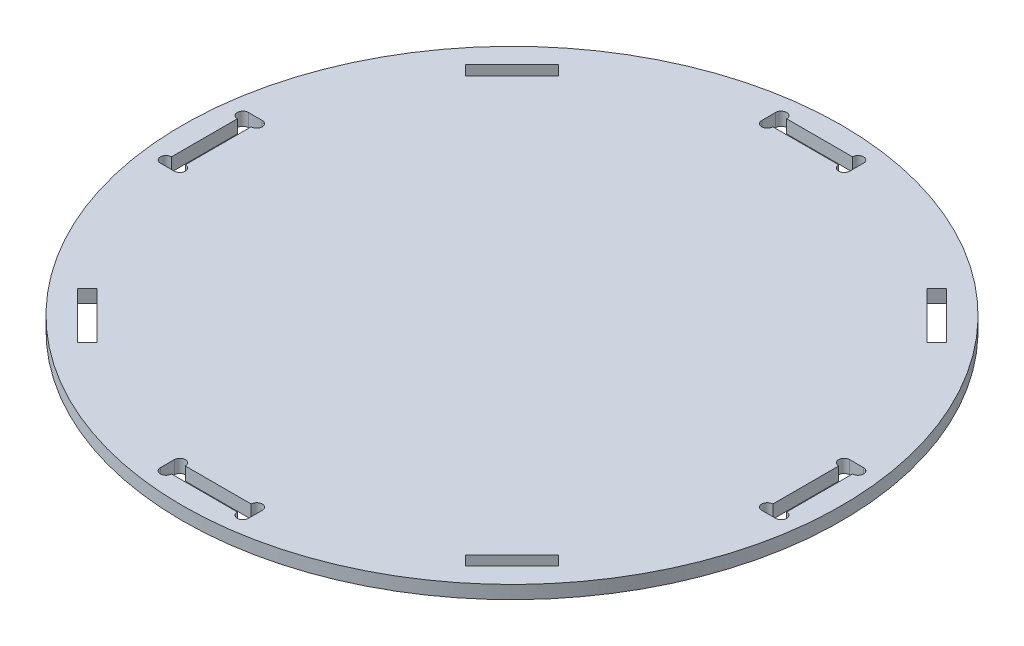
ISO-10303-21;
HEADER;
FILE_DESCRIPTION(('STEP AP214'),'2;1');
FILE_NAME('part.step','',(''),(''),'','','');
FILE_SCHEMA(('AUTOMOTIVE_DESIGN { 1 0 10303 214 1 1 1 1 }'));
ENDSEC;
DATA;
#1=APPLICATION_CONTEXT('core data for automotive mechanical design processes');
#2=APPLICATION_PROTOCOL_DEFINITION('international standard','automotive_design',2000,#1);
#3=PRODUCT_CONTEXT('',#1,'mechanical');
#4=PRODUCT('Part','Part','',(#3));
#5=PRODUCT_RELATED_PRODUCT_CATEGORY('part','',(#4));
#6=PRODUCT_DEFINITION_FORMATION('','',#4);
#7=PRODUCT_DEFINITION_CONTEXT('part definition',#1,'design');
#8=PRODUCT_DEFINITION('design','',#6,#7);
#9=PRODUCT_DEFINITION_SHAPE('','',#8);
#10=(LENGTH_UNIT() NAMED_UNIT(*) SI_UNIT(.MILLI.,.METRE.));
#11=(NAMED_UNIT(*) PLANE_ANGLE_UNIT() SI_UNIT($,.RADIAN.));
#12=(NAMED_UNIT(*) SI_UNIT($,.STERADIAN.) SOLID_ANGLE_UNIT());
#13=UNCERTAINTY_MEASURE_WITH_UNIT(LENGTH_MEASURE(1.E-05),#10,'distance_accuracy_value','');
#14=(GEOMETRIC_REPRESENTATION_CONTEXT(3) GLOBAL_UNCERTAINTY_ASSIGNED_CONTEXT((#13)) GLOBAL_UNIT_ASSIGNED_CONTEXT((#10,
#11,#12)) REPRESENTATION_CONTEXT('',''));
#15=CARTESIAN_POINT('',(0.,0.,0.));
#16=DIRECTION('',(0.,0.,1.));
#17=DIRECTION('',(1.,0.,0.));
#18=AXIS2_PLACEMENT_3D('',#15,#16,#17);
#19=CARTESIAN_POINT('',(0.,12.,0.));
#20=DIRECTION('',(0.,-1.,0.));
#21=DIRECTION('',(0.,0.,-1.));
#22=AXIS2_PLACEMENT_3D('',#19,#20,#21);
#23=CYLINDRICAL_SURFACE('',#22,300.);
#24=CARTESIAN_POINT('',(0.,12.,0.));
#25=DIRECTION('',(0.,1.,0.));
#26=DIRECTION('',(0.,0.,1.));
#27=AXIS2_PLACEMENT_3D('',#24,#25,#26);
#28=CIRCLE('',#27,300.);
#29=CARTESIAN_POINT('',(0.,12.,300.));
#30=VERTEX_POINT('',#29);
#31=EDGE_CURVE('E11',#30,#30,#28,.T.);
#32=ORIENTED_EDGE('',*,*,#31,.F.);
#33=EDGE_LOOP('',(#32));
#34=FACE_BOUND('',#33,.T.);
#35=CARTESIAN_POINT('',(0.,0.,0.));
#36=DIRECTION('',(0.,1.,0.));
#37=DIRECTION('',(0.,0.,1.));
#38=AXIS2_PLACEMENT_3D('',#35,#36,#37);
#39=CIRCLE('',#38,300.);
#40=CARTESIAN_POINT('',(0.,0.,300.));
#41=VERTEX_POINT('',#40);
#42=EDGE_CURVE('E35',#41,#41,#39,.T.);
#43=ORIENTED_EDGE('',*,*,#42,.T.);
#44=EDGE_LOOP('',(#43));
#45=FACE_BOUND('',#44,.T.);
#46=ADVANCED_FACE('F32',(#34,#45),#23,.T.);
#47=CARTESIAN_POINT('',(0.,12.,0.));
#48=DIRECTION('',(0.,1.,0.));
#49=DIRECTION('',(0.,0.,1.));
#50=AXIS2_PLACEMENT_3D('',#47,#48,#49);
#51=PLANE('',#50);
#52=DIRECTION('',(0.707106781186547,0.,-0.707106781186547));
#53=VECTOR('',#52,1.);
#54=CARTESIAN_POINT('',(-167.661196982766,12.,210.087603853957));
#55=LINE('',#54,#53);
#56=CARTESIAN_POINT('',(-176.500031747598,12.,218.926438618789));
#57=VERTEX_POINT('',#56);
#58=CARTESIAN_POINT('',(-167.661196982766,12.,210.087603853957));
#59=VERTEX_POINT('',#58);
#60=EDGE_CURVE('E46',#57,#59,#55,.T.);
#61=ORIENTED_EDGE('',*,*,#60,.F.);
#62=DIRECTION('',(0.707106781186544,0.,0.707106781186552));
#63=VECTOR('',#62,1.);
#64=CARTESIAN_POINT('',(-176.500031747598,12.,218.926438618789));
#65=LINE('',#64,#63);
#66=CARTESIAN_POINT('',(-218.92643861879,12.,176.500031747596));
#67=VERTEX_POINT('',#66);
#68=EDGE_CURVE('E415',#67,#57,#65,.T.);
#69=ORIENTED_EDGE('',*,*,#68,.F.);
#70=DIRECTION('',(-0.707106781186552,0.,0.707106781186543));
#71=VECTOR('',#70,1.);
#72=CARTESIAN_POINT('',(-218.92643861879,12.,176.500031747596));
#73=LINE('',#72,#71);
#74=CARTESIAN_POINT('',(-210.087603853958,12.,167.661196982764));
#75=VERTEX_POINT('',#74);
#76=EDGE_CURVE('E429',#75,#67,#73,.T.);
#77=ORIENTED_EDGE('',*,*,#76,.F.);
#78=DIRECTION('',(-0.707106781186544,0.,-0.707106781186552));
#79=VECTOR('',#78,1.);
#80=CARTESIAN_POINT('',(-210.087603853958,12.,167.661196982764));
#81=LINE('',#80,#79);
#82=EDGE_CURVE('E426',#59,#75,#81,.T.);
#83=ORIENTED_EDGE('',*,*,#82,.F.);
#84=EDGE_LOOP('',(#61,#69,#77,#83));
#85=FACE_BOUND('',#84,.T.);
#86=DIRECTION('',(-0.707106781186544,0.,-0.707106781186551));
#87=VECTOR('',#86,1.);
#88=CARTESIAN_POINT('',(210.087603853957,12.,167.661196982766));
#89=LINE('',#88,#87);
#90=CARTESIAN_POINT('',(218.926438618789,12.,176.500031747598));
#91=VERTEX_POINT('',#90);
#92=CARTESIAN_POINT('',(210.087603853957,12.,167.661196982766));
#93=VERTEX_POINT('',#92);
#94=EDGE_CURVE('E54',#91,#93,#89,.T.);
#95=ORIENTED_EDGE('',*,*,#94,.F.);
#96=DIRECTION('',(0.707106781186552,0.,-0.707106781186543));
#97=VECTOR('',#96,1.);
#98=CARTESIAN_POINT('',(218.926438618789,12.,176.500031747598));
#99=LINE('',#98,#97);
#100=CARTESIAN_POINT('',(176.500031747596,12.,218.92643861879));
#101=VERTEX_POINT('',#100);
#102=EDGE_CURVE('E385',#101,#91,#99,.T.);
#103=ORIENTED_EDGE('',*,*,#102,.F.);
#104=DIRECTION('',(0.707106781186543,0.,0.707106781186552));
#105=VECTOR('',#104,1.);
#106=CARTESIAN_POINT('',(176.500031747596,12.,218.92643861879));
#107=LINE('',#106,#105);
#108=CARTESIAN_POINT('',(167.661196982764,12.,210.087603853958));
#109=VERTEX_POINT('',#108);
#110=EDGE_CURVE('E400',#109,#101,#107,.T.);
#111=ORIENTED_EDGE('',*,*,#110,.F.);
#112=DIRECTION('',(-0.707106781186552,0.,0.707106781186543));
#113=VECTOR('',#112,1.);
#114=CARTESIAN_POINT('',(167.661196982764,12.,210.087603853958));
#115=LINE('',#114,#113);
#116=EDGE_CURVE('E396',#93,#109,#115,.T.);
#117=ORIENTED_EDGE('',*,*,#116,.F.);
#118=EDGE_LOOP('',(#95,#103,#111,#117));
#119=FACE_BOUND('',#118,.T.);
#120=DIRECTION('',(-0.707106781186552,0.,0.707106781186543));
#121=VECTOR('',#120,1.);
#122=CARTESIAN_POINT('',(167.661196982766,12.,-210.087603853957));
#123=LINE('',#122,#121);
#124=CARTESIAN_POINT('',(176.500031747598,12.,-218.926438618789));
#125=VERTEX_POINT('',#124);
#126=CARTESIAN_POINT('',(167.661196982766,12.,-210.087603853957));
#127=VERTEX_POINT('',#126);
#128=EDGE_CURVE('E343',#125,#127,#123,.T.);
#129=ORIENTED_EDGE('',*,*,#128,.F.);
#130=DIRECTION('',(-0.707106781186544,0.,-0.707106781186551));
#131=VECTOR('',#130,1.);
#132=CARTESIAN_POINT('',(176.500031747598,12.,-218.926438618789));
#133=LINE('',#132,#131);
#134=CARTESIAN_POINT('',(218.92643861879,12.,-176.500031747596));
#135=VERTEX_POINT('',#134);
#136=EDGE_CURVE('E361',#135,#125,#133,.T.);
#137=ORIENTED_EDGE('',*,*,#136,.F.);
#138=DIRECTION('',(0.707106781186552,0.,-0.707106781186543));
#139=VECTOR('',#138,1.);
#140=CARTESIAN_POINT('',(218.92643861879,12.,-176.500031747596));
#141=LINE('',#140,#139);
#142=CARTESIAN_POINT('',(210.087603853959,12.,-167.661196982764));
#143=VERTEX_POINT('',#142);
#144=EDGE_CURVE('E364',#143,#135,#141,.T.);
#145=ORIENTED_EDGE('',*,*,#144,.F.);
#146=DIRECTION('',(0.707106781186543,0.,0.707106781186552));
#147=VECTOR('',#146,1.);
#148=CARTESIAN_POINT('',(210.087603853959,12.,-167.661196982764));
#149=LINE('',#148,#147);
#150=EDGE_CURVE('E370',#127,#143,#149,.T.);
#151=ORIENTED_EDGE('',*,*,#150,.F.);
#152=EDGE_LOOP('',(#129,#137,#145,#151));
#153=FACE_BOUND('',#152,.T.);
#154=DIRECTION('',(0.707106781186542,0.,0.707106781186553));
#155=VECTOR('',#154,1.);
#156=CARTESIAN_POINT('',(-210.087603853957,12.,-167.661196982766));
#157=LINE('',#156,#155);
#158=CARTESIAN_POINT('',(-218.926438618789,12.,-176.500031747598));
#159=VERTEX_POINT('',#158);
#160=CARTESIAN_POINT('',(-210.087603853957,12.,-167.661196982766));
#161=VERTEX_POINT('',#160);
#162=EDGE_CURVE('E377',#159,#161,#157,.T.);
#163=ORIENTED_EDGE('',*,*,#162,.F.);
#164=DIRECTION('',(-0.707106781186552,0.,0.707106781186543));
#165=VECTOR('',#164,1.);
#166=CARTESIAN_POINT('',(-218.926438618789,12.,-176.500031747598));
#167=LINE('',#166,#165);
#168=CARTESIAN_POINT('',(-176.500031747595,12.,-218.92643861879));
#169=VERTEX_POINT('',#168);
#170=EDGE_CURVE('E444',#169,#159,#167,.T.);
#171=ORIENTED_EDGE('',*,*,#170,.F.);
#172=DIRECTION('',(-0.707106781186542,0.,-0.707106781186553));
#173=VECTOR('',#172,1.);
#174=CARTESIAN_POINT('',(-176.500031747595,12.,-218.92643861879));
#175=LINE('',#174,#173);
#176=CARTESIAN_POINT('',(-167.661196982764,12.,-210.087603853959));
#177=VERTEX_POINT('',#176);
#178=EDGE_CURVE('E458',#177,#169,#175,.T.);
#179=ORIENTED_EDGE('',*,*,#178,.F.);
#180=DIRECTION('',(0.707106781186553,0.,-0.707106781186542));
#181=VECTOR('',#180,1.);
#182=CARTESIAN_POINT('',(-167.661196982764,12.,-210.087603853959));
#183=LINE('',#182,#181);
#184=EDGE_CURVE('E455',#161,#177,#183,.T.);
#185=ORIENTED_EDGE('',*,*,#184,.F.);
#186=EDGE_LOOP('',(#163,#171,#179,#185));
#187=FACE_BOUND('',#186,.T.);
#188=CARTESIAN_POINT('',(34.9998061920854,12.,-280.044023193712));
#189=DIRECTION('',(0.,1.,0.));
#190=DIRECTION('',(0.,0.,-1.));
#191=AXIS2_PLACEMENT_3D('',#188,#189,#190);
#192=CIRCLE('',#191,5.);
#193=CARTESIAN_POINT('',(39.9996123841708,12.,-280.));
#194=VERTEX_POINT('',#193);
#195=CARTESIAN_POINT('',(30.,12.,-280.));
#196=VERTEX_POINT('',#195);
#197=EDGE_CURVE('E498',#194,#196,#192,.T.);
#198=ORIENTED_EDGE('',*,*,#197,.F.);
#199=DIRECTION('',(0.,0.,-1.));
#200=VECTOR('',#199,1.);
#201=CARTESIAN_POINT('',(39.9996123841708,12.,-280.));
#202=LINE('',#201,#200);
#203=CARTESIAN_POINT('',(39.9996123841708,12.,-267.4));
#204=VERTEX_POINT('',#203);
#205=EDGE_CURVE('E476',#204,#194,#202,.T.);
#206=ORIENTED_EDGE('',*,*,#205,.F.);
#207=CARTESIAN_POINT('',(34.9998061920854,12.,-267.355976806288));
#208=DIRECTION('',(0.,1.,0.));
#209=DIRECTION('',(0.,0.,1.));
#210=AXIS2_PLACEMENT_3D('',#207,#208,#209);
#211=CIRCLE('',#210,5.00000000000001);
#212=CARTESIAN_POINT('',(30.,12.,-267.4));
#213=VERTEX_POINT('',#212);
#214=EDGE_CURVE('E516',#213,#204,#211,.T.);
#215=ORIENTED_EDGE('',*,*,#214,.F.);
#216=DIRECTION('',(1.,0.,0.));
#217=VECTOR('',#216,1.);
#218=CARTESIAN_POINT('',(-30.,12.,-267.4));
#219=LINE('',#218,#217);
#220=CARTESIAN_POINT('',(-30.,12.,-267.4));
#221=VERTEX_POINT('',#220);
#222=EDGE_CURVE('E513',#221,#213,#219,.T.);
#223=ORIENTED_EDGE('',*,*,#222,.F.);
#224=CARTESIAN_POINT('',(-34.9998061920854,12.,-267.355976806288));
#225=DIRECTION('',(0.,1.,0.));
#226=DIRECTION('',(0.,0.,-1.));
#227=AXIS2_PLACEMENT_3D('',#224,#225,#226);
#228=CIRCLE('',#227,5.);
#229=CARTESIAN_POINT('',(-39.9996123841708,12.,-267.4));
#230=VERTEX_POINT('',#229);
#231=EDGE_CURVE('E510',#230,#221,#228,.T.);
#232=ORIENTED_EDGE('',*,*,#231,.F.);
#233=DIRECTION('',(0.,0.,1.));
#234=VECTOR('',#233,1.);
#235=CARTESIAN_POINT('',(-39.9996123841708,12.,-280.));
#236=LINE('',#235,#234);
#237=CARTESIAN_POINT('',(-39.9996123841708,12.,-280.));
#238=VERTEX_POINT('',#237);
#239=EDGE_CURVE('E507',#238,#230,#236,.T.);
#240=ORIENTED_EDGE('',*,*,#239,.F.);
#241=CARTESIAN_POINT('',(-34.9998061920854,12.,-280.044023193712));
#242=DIRECTION('',(0.,1.,0.));
#243=DIRECTION('',(0.,0.,1.));
#244=AXIS2_PLACEMENT_3D('',#241,#242,#243);
#245=CIRCLE('',#244,5.);
#246=CARTESIAN_POINT('',(-30.,12.,-280.));
#247=VERTEX_POINT('',#246);
#248=EDGE_CURVE('E504',#247,#238,#245,.T.);
#249=ORIENTED_EDGE('',*,*,#248,.F.);
#250=DIRECTION('',(-1.,0.,0.));
#251=VECTOR('',#250,1.);
#252=CARTESIAN_POINT('',(-30.,12.,-280.));
#253=LINE('',#252,#251);
#254=EDGE_CURVE('E500',#196,#247,#253,.T.);
#255=ORIENTED_EDGE('',*,*,#254,.F.);
#256=EDGE_LOOP('',(#198,#206,#215,#223,#232,#240,#249,#255));
#257=FACE_BOUND('',#256,.T.);
#258=CARTESIAN_POINT('',(280.044023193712,12.,34.9998061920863));
#259=DIRECTION('',(0.,1.,0.));
#260=DIRECTION('',(0.,0.,-1.));
#261=AXIS2_PLACEMENT_3D('',#258,#259,#260);
#262=CIRCLE('',#261,5.);
#263=CARTESIAN_POINT('',(280.,12.,39.9996123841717));
#264=VERTEX_POINT('',#263);
#265=CARTESIAN_POINT('',(280.,12.,30.0000000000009));
#266=VERTEX_POINT('',#265);
#267=EDGE_CURVE('E563',#264,#266,#262,.T.);
#268=ORIENTED_EDGE('',*,*,#267,.F.);
#269=DIRECTION('',(1.,0.,0.));
#270=VECTOR('',#269,1.);
#271=CARTESIAN_POINT('',(280.,12.,39.9996123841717));
#272=LINE('',#271,#270);
#273=CARTESIAN_POINT('',(267.4,12.,39.9996123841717));
#274=VERTEX_POINT('',#273);
#275=EDGE_CURVE('E541',#274,#264,#272,.T.);
#276=ORIENTED_EDGE('',*,*,#275,.F.);
#277=CARTESIAN_POINT('',(267.355976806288,12.,34.9998061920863));
#278=DIRECTION('',(0.,1.,0.));
#279=DIRECTION('',(0.,0.,1.));
#280=AXIS2_PLACEMENT_3D('',#277,#278,#279);
#281=CIRCLE('',#280,5.00000000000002);
#282=CARTESIAN_POINT('',(267.4,12.,30.0000000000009));
#283=VERTEX_POINT('',#282);
#284=EDGE_CURVE('E581',#283,#274,#281,.T.);
#285=ORIENTED_EDGE('',*,*,#284,.F.);
#286=DIRECTION('',(0.,0.,1.));
#287=VECTOR('',#286,1.);
#288=CARTESIAN_POINT('',(267.4,12.,-29.9999999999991));
#289=LINE('',#288,#287);
#290=CARTESIAN_POINT('',(267.4,12.,-29.9999999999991));
#291=VERTEX_POINT('',#290);
#292=EDGE_CURVE('E578',#291,#283,#289,.T.);
#293=ORIENTED_EDGE('',*,*,#292,.F.);
#294=CARTESIAN_POINT('',(267.355976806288,12.,-34.9998061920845));
#295=DIRECTION('',(0.,1.,0.));
#296=DIRECTION('',(0.,0.,-1.));
#297=AXIS2_PLACEMENT_3D('',#294,#295,#296);
#298=CIRCLE('',#297,5.);
#299=CARTESIAN_POINT('',(267.4,12.,-39.9996123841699));
#300=VERTEX_POINT('',#299);
#301=EDGE_CURVE('E575',#300,#291,#298,.T.);
#302=ORIENTED_EDGE('',*,*,#301,.F.);
#303=DIRECTION('',(-1.,0.,0.));
#304=VECTOR('',#303,1.);
#305=CARTESIAN_POINT('',(280.,12.,-39.9996123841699));
#306=LINE('',#305,#304);
#307=CARTESIAN_POINT('',(280.,12.,-39.9996123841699));
#308=VERTEX_POINT('',#307);
#309=EDGE_CURVE('E572',#308,#300,#306,.T.);
#310=ORIENTED_EDGE('',*,*,#309,.F.);
#311=CARTESIAN_POINT('',(280.044023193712,12.,-34.9998061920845));
#312=DIRECTION('',(0.,1.,0.));
#313=DIRECTION('',(0.,0.,1.));
#314=AXIS2_PLACEMENT_3D('',#311,#312,#313);
#315=CIRCLE('',#314,5.);
#316=CARTESIAN_POINT('',(280.,12.,-29.9999999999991));
#317=VERTEX_POINT('',#316);
#318=EDGE_CURVE('E569',#317,#308,#315,.T.);
#319=ORIENTED_EDGE('',*,*,#318,.F.);
#320=DIRECTION('',(0.,0.,-1.));
#321=VECTOR('',#320,1.);
#322=CARTESIAN_POINT('',(280.,12.,-29.9999999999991));
#323=LINE('',#322,#321);
#324=EDGE_CURVE('E565',#266,#317,#323,.T.);
#325=ORIENTED_EDGE('',*,*,#324,.F.);
#326=EDGE_LOOP('',(#268,#276,#285,#293,#302,#310,#319,#325));
#327=FACE_BOUND('',#326,.T.);
#328=CARTESIAN_POINT('',(-34.9998061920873,12.,280.044023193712));
#329=DIRECTION('',(0.,1.,0.));
#330=DIRECTION('',(0.,0.,-1.));
#331=AXIS2_PLACEMENT_3D('',#328,#329,#330);
#332=CIRCLE('',#331,5.);
#333=CARTESIAN_POINT('',(-39.9996123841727,12.,280.));
#334=VERTEX_POINT('',#333);
#335=CARTESIAN_POINT('',(-30.000000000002,12.,280.));
#336=VERTEX_POINT('',#335);
#337=EDGE_CURVE('E627',#334,#336,#332,.T.);
#338=ORIENTED_EDGE('',*,*,#337,.F.);
#339=DIRECTION('',(0.,0.,1.));
#340=VECTOR('',#339,1.);
#341=CARTESIAN_POINT('',(-39.9996123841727,12.,280.));
#342=LINE('',#341,#340);
#343=CARTESIAN_POINT('',(-39.9996123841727,12.,267.4));
#344=VERTEX_POINT('',#343);
#345=EDGE_CURVE('E605',#344,#334,#342,.T.);
#346=ORIENTED_EDGE('',*,*,#345,.F.);
#347=CARTESIAN_POINT('',(-34.9998061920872,12.,267.355976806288));
#348=DIRECTION('',(0.,1.,0.));
#349=DIRECTION('',(0.,0.,1.));
#350=AXIS2_PLACEMENT_3D('',#347,#348,#349);
#351=CIRCLE('',#350,5.00000000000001);
#352=CARTESIAN_POINT('',(-30.0000000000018,12.,267.4));
#353=VERTEX_POINT('',#352);
#354=EDGE_CURVE('E645',#353,#344,#351,.T.);
#355=ORIENTED_EDGE('',*,*,#354,.F.);
#356=DIRECTION('',(-1.,0.,0.));
#357=VECTOR('',#356,1.);
#358=CARTESIAN_POINT('',(29.9999999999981,12.,267.4));
#359=LINE('',#358,#357);
#360=CARTESIAN_POINT('',(29.9999999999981,12.,267.4));
#361=VERTEX_POINT('',#360);
#362=EDGE_CURVE('E642',#361,#353,#359,.T.);
#363=ORIENTED_EDGE('',*,*,#362,.F.);
#364=CARTESIAN_POINT('',(34.9998061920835,12.,267.355976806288));
#365=DIRECTION('',(0.,1.,0.));
#366=DIRECTION('',(0.,0.,-1.));
#367=AXIS2_PLACEMENT_3D('',#364,#365,#366);
#368=CIRCLE('',#367,5.);
#369=CARTESIAN_POINT('',(39.9996123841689,12.,267.4));
#370=VERTEX_POINT('',#369);
#371=EDGE_CURVE('E639',#370,#361,#368,.T.);
#372=ORIENTED_EDGE('',*,*,#371,.F.);
#373=DIRECTION('',(0.,0.,-1.));
#374=VECTOR('',#373,1.);
#375=CARTESIAN_POINT('',(39.9996123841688,12.,280.));
#376=LINE('',#375,#374);
#377=CARTESIAN_POINT('',(39.9996123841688,12.,280.));
#378=VERTEX_POINT('',#377);
#379=EDGE_CURVE('E636',#378,#370,#376,.T.);
#380=ORIENTED_EDGE('',*,*,#379,.F.);
#381=CARTESIAN_POINT('',(34.9998061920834,12.,280.044023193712));
#382=DIRECTION('',(0.,1.,0.));
#383=DIRECTION('',(0.,0.,1.));
#384=AXIS2_PLACEMENT_3D('',#381,#382,#383);
#385=CIRCLE('',#384,5.);
#386=CARTESIAN_POINT('',(29.999999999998,12.,280.));
#387=VERTEX_POINT('',#386);
#388=EDGE_CURVE('E633',#387,#378,#385,.T.);
#389=ORIENTED_EDGE('',*,*,#388,.F.);
#390=DIRECTION('',(1.,0.,0.));
#391=VECTOR('',#390,1.);
#392=CARTESIAN_POINT('',(29.999999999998,12.,280.));
#393=LINE('',#392,#391);
#394=EDGE_CURVE('E629',#336,#387,#393,.T.);
#395=ORIENTED_EDGE('',*,*,#394,.F.);
#396=EDGE_LOOP('',(#338,#346,#355,#363,#372,#380,#389,#395));
#397=FACE_BOUND('',#396,.T.);
#398=CARTESIAN_POINT('',(-280.044023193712,12.,-34.9998061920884));
#399=DIRECTION('',(0.,1.,0.));
#400=DIRECTION('',(0.,0.,-1.));
#401=AXIS2_PLACEMENT_3D('',#398,#399,#400);
#402=CIRCLE('',#401,5.);
#403=CARTESIAN_POINT('',(-280.,12.,-39.9996123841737));
#404=VERTEX_POINT('',#403);
#405=CARTESIAN_POINT('',(-280.,12.,-30.000000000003));
#406=VERTEX_POINT('',#405);
#407=EDGE_CURVE('E465',#404,#406,#402,.T.);
#408=ORIENTED_EDGE('',*,*,#407,.F.);
#409=DIRECTION('',(-1.,0.,0.));
#410=VECTOR('',#409,1.);
#411=CARTESIAN_POINT('',(-280.,12.,-39.9996123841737));
#412=LINE('',#411,#410);
#413=CARTESIAN_POINT('',(-267.4,12.,-39.9996123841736));
#414=VERTEX_POINT('',#413);
#415=EDGE_CURVE('E669',#414,#404,#412,.T.);
#416=ORIENTED_EDGE('',*,*,#415,.F.);
#417=CARTESIAN_POINT('',(-267.355976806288,12.,-34.9998061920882));
#418=DIRECTION('',(0.,1.,0.));
#419=DIRECTION('',(0.,0.,1.));
#420=AXIS2_PLACEMENT_3D('',#417,#418,#419);
#421=CIRCLE('',#420,5.00000000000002);
#422=CARTESIAN_POINT('',(-267.4,12.,-30.0000000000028));
#423=VERTEX_POINT('',#422);
#424=EDGE_CURVE('E707',#423,#414,#421,.T.);
#425=ORIENTED_EDGE('',*,*,#424,.F.);
#426=DIRECTION('',(0.,0.,-1.));
#427=VECTOR('',#426,1.);
#428=CARTESIAN_POINT('',(-267.4,12.,29.9999999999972));
#429=LINE('',#428,#427);
#430=CARTESIAN_POINT('',(-267.4,12.,29.9999999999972));
#431=VERTEX_POINT('',#430);
#432=EDGE_CURVE('E704',#431,#423,#429,.T.);
#433=ORIENTED_EDGE('',*,*,#432,.F.);
#434=CARTESIAN_POINT('',(-267.355976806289,12.,34.9998061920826));
#435=DIRECTION('',(0.,1.,0.));
#436=DIRECTION('',(0.,0.,-1.));
#437=AXIS2_PLACEMENT_3D('',#434,#435,#436);
#438=CIRCLE('',#437,5.);
#439=CARTESIAN_POINT('',(-267.400000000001,12.,39.999612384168));
#440=VERTEX_POINT('',#439);
#441=EDGE_CURVE('E701',#440,#431,#438,.T.);
#442=ORIENTED_EDGE('',*,*,#441,.F.);
#443=DIRECTION('',(1.,0.,0.));
#444=VECTOR('',#443,1.);
#445=CARTESIAN_POINT('',(-280.000000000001,12.,39.9996123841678));
#446=LINE('',#445,#444);
#447=CARTESIAN_POINT('',(-280.000000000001,12.,39.9996123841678));
#448=VERTEX_POINT('',#447);
#449=EDGE_CURVE('E698',#448,#440,#446,.T.);
#450=ORIENTED_EDGE('',*,*,#449,.F.);
#451=CARTESIAN_POINT('',(-280.044023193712,12.,34.9998061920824));
#452=DIRECTION('',(0.,1.,0.));
#453=DIRECTION('',(0.,0.,1.));
#454=AXIS2_PLACEMENT_3D('',#451,#452,#453);
#455=CIRCLE('',#454,5.);
#456=CARTESIAN_POINT('',(-280.,12.,29.999999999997));
#457=VERTEX_POINT('',#456);
#458=EDGE_CURVE('E695',#457,#448,#455,.T.);
#459=ORIENTED_EDGE('',*,*,#458,.F.);
#460=DIRECTION('',(0.,0.,1.));
#461=VECTOR('',#460,1.);
#462=CARTESIAN_POINT('',(-280.,12.,29.999999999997));
#463=LINE('',#462,#461);
#464=EDGE_CURVE('E692',#406,#457,#463,.T.);
#465=ORIENTED_EDGE('',*,*,#464,.F.);
#466=EDGE_LOOP('',(#408,#416,#425,#433,#442,#450,#459,#465));
#467=FACE_BOUND('',#466,.T.);
#468=ORIENTED_EDGE('',*,*,#31,.T.);
#469=EDGE_LOOP('',(#468));
#470=FACE_BOUND('',#469,.T.);
#471=ADVANCED_FACE('F736',(#85,#119,#153,#187,#257,#327,#397,#467,#470),#51,.T.);
#472=CARTESIAN_POINT('',(0.,0.,0.));
#473=DIRECTION('',(0.,1.,0.));
#474=DIRECTION('',(0.,0.,1.));
#475=AXIS2_PLACEMENT_3D('',#472,#473,#474);
#476=PLANE('',#475);
#477=DIRECTION('',(0.707106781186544,0.,0.707106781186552));
#478=VECTOR('',#477,1.);
#479=CARTESIAN_POINT('',(-176.500031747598,0.,218.926438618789));
#480=LINE('',#479,#478);
#481=CARTESIAN_POINT('',(-218.92643861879,0.,176.500031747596));
#482=VERTEX_POINT('',#481);
#483=CARTESIAN_POINT('',(-176.500031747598,0.,218.926438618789));
#484=VERTEX_POINT('',#483);
#485=EDGE_CURVE('E421',#482,#484,#480,.T.);
#486=ORIENTED_EDGE('',*,*,#485,.T.);
#487=DIRECTION('',(0.707106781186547,0.,-0.707106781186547));
#488=VECTOR('',#487,1.);
#489=CARTESIAN_POINT('',(-167.661196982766,0.,210.087603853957));
#490=LINE('',#489,#488);
#491=CARTESIAN_POINT('',(-167.661196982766,0.,210.087603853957));
#492=VERTEX_POINT('',#491);
#493=EDGE_CURVE('E411',#484,#492,#490,.T.);
#494=ORIENTED_EDGE('',*,*,#493,.T.);
#495=DIRECTION('',(-0.707106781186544,0.,-0.707106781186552));
#496=VECTOR('',#495,1.);
#497=CARTESIAN_POINT('',(-210.087603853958,0.,167.661196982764));
#498=LINE('',#497,#496);
#499=CARTESIAN_POINT('',(-210.087603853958,0.,167.661196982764));
#500=VERTEX_POINT('',#499);
#501=EDGE_CURVE('E414',#492,#500,#498,.T.);
#502=ORIENTED_EDGE('',*,*,#501,.T.);
#503=DIRECTION('',(-0.707106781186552,0.,0.707106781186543));
#504=VECTOR('',#503,1.);
#505=CARTESIAN_POINT('',(-218.92643861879,0.,176.500031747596));
#506=LINE('',#505,#504);
#507=EDGE_CURVE('E418',#500,#482,#506,.T.);
#508=ORIENTED_EDGE('',*,*,#507,.T.);
#509=EDGE_LOOP('',(#486,#494,#502,#508));
#510=FACE_BOUND('',#509,.T.);
#511=DIRECTION('',(0.707106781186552,0.,-0.707106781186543));
#512=VECTOR('',#511,1.);
#513=CARTESIAN_POINT('',(218.926438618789,0.,176.500031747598));
#514=LINE('',#513,#512);
#515=CARTESIAN_POINT('',(176.500031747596,0.,218.92643861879));
#516=VERTEX_POINT('',#515);
#517=CARTESIAN_POINT('',(218.926438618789,0.,176.500031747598));
#518=VERTEX_POINT('',#517);
#519=EDGE_CURVE('E391',#516,#518,#514,.T.);
#520=ORIENTED_EDGE('',*,*,#519,.T.);
#521=DIRECTION('',(-0.707106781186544,0.,-0.707106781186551));
#522=VECTOR('',#521,1.);
#523=CARTESIAN_POINT('',(210.087603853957,0.,167.661196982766));
#524=LINE('',#523,#522);
#525=CARTESIAN_POINT('',(210.087603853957,0.,167.661196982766));
#526=VERTEX_POINT('',#525);
#527=EDGE_CURVE('E381',#518,#526,#524,.T.);
#528=ORIENTED_EDGE('',*,*,#527,.T.);
#529=DIRECTION('',(-0.707106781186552,0.,0.707106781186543));
#530=VECTOR('',#529,1.);
#531=CARTESIAN_POINT('',(167.661196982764,0.,210.087603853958));
#532=LINE('',#531,#530);
#533=CARTESIAN_POINT('',(167.661196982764,0.,210.087603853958));
#534=VERTEX_POINT('',#533);
#535=EDGE_CURVE('E384',#526,#534,#532,.T.);
#536=ORIENTED_EDGE('',*,*,#535,.T.);
#537=DIRECTION('',(0.707106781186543,0.,0.707106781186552));
#538=VECTOR('',#537,1.);
#539=CARTESIAN_POINT('',(176.500031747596,0.,218.92643861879));
#540=LINE('',#539,#538);
#541=EDGE_CURVE('E388',#534,#516,#540,.T.);
#542=ORIENTED_EDGE('',*,*,#541,.T.);
#543=EDGE_LOOP('',(#520,#528,#536,#542));
#544=FACE_BOUND('',#543,.T.);
#545=DIRECTION('',(-0.707106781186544,0.,-0.707106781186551));
#546=VECTOR('',#545,1.);
#547=CARTESIAN_POINT('',(176.500031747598,0.,-218.926438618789));
#548=LINE('',#547,#546);
#549=CARTESIAN_POINT('',(218.92643861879,0.,-176.500031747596));
#550=VERTEX_POINT('',#549);
#551=CARTESIAN_POINT('',(176.500031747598,0.,-218.926438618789));
#552=VERTEX_POINT('',#551);
#553=EDGE_CURVE('E348',#550,#552,#548,.T.);
#554=ORIENTED_EDGE('',*,*,#553,.T.);
#555=DIRECTION('',(-0.707106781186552,0.,0.707106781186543));
#556=VECTOR('',#555,1.);
#557=CARTESIAN_POINT('',(167.661196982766,0.,-210.087603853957));
#558=LINE('',#557,#556);
#559=CARTESIAN_POINT('',(167.661196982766,0.,-210.087603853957));
#560=VERTEX_POINT('',#559);
#561=EDGE_CURVE('E340',#552,#560,#558,.T.);
#562=ORIENTED_EDGE('',*,*,#561,.T.);
#563=DIRECTION('',(0.707106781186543,0.,0.707106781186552));
#564=VECTOR('',#563,1.);
#565=CARTESIAN_POINT('',(210.087603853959,0.,-167.661196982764));
#566=LINE('',#565,#564);
#567=CARTESIAN_POINT('',(210.087603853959,0.,-167.661196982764));
#568=VERTEX_POINT('',#567);
#569=EDGE_CURVE('E352',#560,#568,#566,.T.);
#570=ORIENTED_EDGE('',*,*,#569,.T.);
#571=DIRECTION('',(0.707106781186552,0.,-0.707106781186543));
#572=VECTOR('',#571,1.);
#573=CARTESIAN_POINT('',(218.92643861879,0.,-176.500031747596));
#574=LINE('',#573,#572);
#575=EDGE_CURVE('E356',#568,#550,#574,.T.);
#576=ORIENTED_EDGE('',*,*,#575,.T.);
#577=EDGE_LOOP('',(#554,#562,#570,#576));
#578=FACE_BOUND('',#577,.T.);
#579=DIRECTION('',(-0.707106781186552,0.,0.707106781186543));
#580=VECTOR('',#579,1.);
#581=CARTESIAN_POINT('',(-218.926438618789,0.,-176.500031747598));
#582=LINE('',#581,#580);
#583=CARTESIAN_POINT('',(-176.500031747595,0.,-218.92643861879));
#584=VERTEX_POINT('',#583);
#585=CARTESIAN_POINT('',(-218.926438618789,0.,-176.500031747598));
#586=VERTEX_POINT('',#585);
#587=EDGE_CURVE('E450',#584,#586,#582,.T.);
#588=ORIENTED_EDGE('',*,*,#587,.T.);
#589=DIRECTION('',(0.707106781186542,0.,0.707106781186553));
#590=VECTOR('',#589,1.);
#591=CARTESIAN_POINT('',(-210.087603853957,0.,-167.661196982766));
#592=LINE('',#591,#590);
#593=CARTESIAN_POINT('',(-210.087603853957,0.,-167.661196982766));
#594=VERTEX_POINT('',#593);
#595=EDGE_CURVE('E440',#586,#594,#592,.T.);
#596=ORIENTED_EDGE('',*,*,#595,.T.);
#597=DIRECTION('',(0.707106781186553,0.,-0.707106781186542));
#598=VECTOR('',#597,1.);
#599=CARTESIAN_POINT('',(-167.661196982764,0.,-210.087603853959));
#600=LINE('',#599,#598);
#601=CARTESIAN_POINT('',(-167.661196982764,0.,-210.087603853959));
#602=VERTEX_POINT('',#601);
#603=EDGE_CURVE('E443',#594,#602,#600,.T.);
#604=ORIENTED_EDGE('',*,*,#603,.T.);
#605=DIRECTION('',(-0.707106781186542,0.,-0.707106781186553));
#606=VECTOR('',#605,1.);
#607=CARTESIAN_POINT('',(-176.500031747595,0.,-218.92643861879));
#608=LINE('',#607,#606);
#609=EDGE_CURVE('E447',#602,#584,#608,.T.);
#610=ORIENTED_EDGE('',*,*,#609,.T.);
#611=EDGE_LOOP('',(#588,#596,#604,#610));
#612=FACE_BOUND('',#611,.T.);
#613=DIRECTION('',(0.,0.,-1.));
#614=VECTOR('',#613,1.);
#615=CARTESIAN_POINT('',(39.9996123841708,0.,-280.));
#616=LINE('',#615,#614);
#617=CARTESIAN_POINT('',(39.9996123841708,0.,-267.4));
#618=VERTEX_POINT('',#617);
#619=CARTESIAN_POINT('',(39.9996123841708,0.,-280.));
#620=VERTEX_POINT('',#619);
#621=EDGE_CURVE('E494',#618,#620,#616,.T.);
#622=ORIENTED_EDGE('',*,*,#621,.T.);
#623=CARTESIAN_POINT('',(34.9998061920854,0.,-280.044023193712));
#624=DIRECTION('',(0.,1.,0.));
#625=DIRECTION('',(0.,0.,-1.));
#626=AXIS2_PLACEMENT_3D('',#623,#624,#625);
#627=CIRCLE('',#626,5.);
#628=CARTESIAN_POINT('',(30.,0.,-280.));
#629=VERTEX_POINT('',#628);
#630=EDGE_CURVE('E472',#620,#629,#627,.T.);
#631=ORIENTED_EDGE('',*,*,#630,.T.);
#632=DIRECTION('',(-1.,0.,0.));
#633=VECTOR('',#632,1.);
#634=CARTESIAN_POINT('',(-30.,0.,-280.));
#635=LINE('',#634,#633);
#636=CARTESIAN_POINT('',(-30.,0.,-280.));
#637=VERTEX_POINT('',#636);
#638=EDGE_CURVE('E475',#629,#637,#635,.T.);
#639=ORIENTED_EDGE('',*,*,#638,.T.);
#640=CARTESIAN_POINT('',(-34.9998061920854,0.,-280.044023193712));
#641=DIRECTION('',(0.,1.,0.));
#642=DIRECTION('',(0.,0.,1.));
#643=AXIS2_PLACEMENT_3D('',#640,#641,#642);
#644=CIRCLE('',#643,5.);
#645=CARTESIAN_POINT('',(-39.9996123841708,0.,-280.));
#646=VERTEX_POINT('',#645);
#647=EDGE_CURVE('E479',#637,#646,#644,.T.);
#648=ORIENTED_EDGE('',*,*,#647,.T.);
#649=DIRECTION('',(0.,0.,1.));
#650=VECTOR('',#649,1.);
#651=CARTESIAN_POINT('',(-39.9996123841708,0.,-280.));
#652=LINE('',#651,#650);
#653=CARTESIAN_POINT('',(-39.9996123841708,0.,-267.4));
#654=VERTEX_POINT('',#653);
#655=EDGE_CURVE('E482',#646,#654,#652,.T.);
#656=ORIENTED_EDGE('',*,*,#655,.T.);
#657=CARTESIAN_POINT('',(-34.9998061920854,0.,-267.355976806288));
#658=DIRECTION('',(0.,1.,0.));
#659=DIRECTION('',(0.,0.,-1.));
#660=AXIS2_PLACEMENT_3D('',#657,#658,#659);
#661=CIRCLE('',#660,5.);
#662=CARTESIAN_POINT('',(-30.,0.,-267.4));
#663=VERTEX_POINT('',#662);
#664=EDGE_CURVE('E485',#654,#663,#661,.T.);
#665=ORIENTED_EDGE('',*,*,#664,.T.);
#666=DIRECTION('',(1.,0.,0.));
#667=VECTOR('',#666,1.);
#668=CARTESIAN_POINT('',(-30.,0.,-267.4));
#669=LINE('',#668,#667);
#670=CARTESIAN_POINT('',(30.,0.,-267.4));
#671=VERTEX_POINT('',#670);
#672=EDGE_CURVE('E488',#663,#671,#669,.T.);
#673=ORIENTED_EDGE('',*,*,#672,.T.);
#674=CARTESIAN_POINT('',(34.9998061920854,0.,-267.355976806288));
#675=DIRECTION('',(0.,1.,0.));
#676=DIRECTION('',(0.,0.,1.));
#677=AXIS2_PLACEMENT_3D('',#674,#675,#676);
#678=CIRCLE('',#677,5.00000000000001);
#679=EDGE_CURVE('E491',#671,#618,#678,.T.);
#680=ORIENTED_EDGE('',*,*,#679,.T.);
#681=EDGE_LOOP('',(#622,#631,#639,#648,#656,#665,#673,#680));
#682=FACE_BOUND('',#681,.T.);
#683=DIRECTION('',(1.,0.,0.));
#684=VECTOR('',#683,1.);
#685=CARTESIAN_POINT('',(280.,0.,39.9996123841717));
#686=LINE('',#685,#684);
#687=CARTESIAN_POINT('',(267.4,0.,39.9996123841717));
#688=VERTEX_POINT('',#687);
#689=CARTESIAN_POINT('',(280.,0.,39.9996123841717));
#690=VERTEX_POINT('',#689);
#691=EDGE_CURVE('E559',#688,#690,#686,.T.);
#692=ORIENTED_EDGE('',*,*,#691,.T.);
#693=CARTESIAN_POINT('',(280.044023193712,0.,34.9998061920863));
#694=DIRECTION('',(0.,1.,0.));
#695=DIRECTION('',(0.,0.,-1.));
#696=AXIS2_PLACEMENT_3D('',#693,#694,#695);
#697=CIRCLE('',#696,5.);
#698=CARTESIAN_POINT('',(280.,0.,30.0000000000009));
#699=VERTEX_POINT('',#698);
#700=EDGE_CURVE('E537',#690,#699,#697,.T.);
#701=ORIENTED_EDGE('',*,*,#700,.T.);
#702=DIRECTION('',(0.,0.,-1.));
#703=VECTOR('',#702,1.);
#704=CARTESIAN_POINT('',(280.,0.,-29.9999999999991));
#705=LINE('',#704,#703);
#706=CARTESIAN_POINT('',(280.,0.,-29.9999999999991));
#707=VERTEX_POINT('',#706);
#708=EDGE_CURVE('E540',#699,#707,#705,.T.);
#709=ORIENTED_EDGE('',*,*,#708,.T.);
#710=CARTESIAN_POINT('',(280.044023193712,0.,-34.9998061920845));
#711=DIRECTION('',(0.,1.,0.));
#712=DIRECTION('',(0.,0.,1.));
#713=AXIS2_PLACEMENT_3D('',#710,#711,#712);
#714=CIRCLE('',#713,5.);
#715=CARTESIAN_POINT('',(280.,0.,-39.9996123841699));
#716=VERTEX_POINT('',#715);
#717=EDGE_CURVE('E544',#707,#716,#714,.T.);
#718=ORIENTED_EDGE('',*,*,#717,.T.);
#719=DIRECTION('',(-1.,0.,0.));
#720=VECTOR('',#719,1.);
#721=CARTESIAN_POINT('',(280.,0.,-39.9996123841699));
#722=LINE('',#721,#720);
#723=CARTESIAN_POINT('',(267.4,0.,-39.9996123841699));
#724=VERTEX_POINT('',#723);
#725=EDGE_CURVE('E547',#716,#724,#722,.T.);
#726=ORIENTED_EDGE('',*,*,#725,.T.);
#727=CARTESIAN_POINT('',(267.355976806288,0.,-34.9998061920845));
#728=DIRECTION('',(0.,1.,0.));
#729=DIRECTION('',(0.,0.,-1.));
#730=AXIS2_PLACEMENT_3D('',#727,#728,#729);
#731=CIRCLE('',#730,5.);
#732=CARTESIAN_POINT('',(267.4,0.,-29.9999999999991));
#733=VERTEX_POINT('',#732);
#734=EDGE_CURVE('E550',#724,#733,#731,.T.);
#735=ORIENTED_EDGE('',*,*,#734,.T.);
#736=DIRECTION('',(0.,0.,1.));
#737=VECTOR('',#736,1.);
#738=CARTESIAN_POINT('',(267.4,0.,-29.9999999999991));
#739=LINE('',#738,#737);
#740=CARTESIAN_POINT('',(267.4,0.,30.0000000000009));
#741=VERTEX_POINT('',#740);
#742=EDGE_CURVE('E553',#733,#741,#739,.T.);
#743=ORIENTED_EDGE('',*,*,#742,.T.);
#744=CARTESIAN_POINT('',(267.355976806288,0.,34.9998061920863));
#745=DIRECTION('',(0.,1.,0.));
#746=DIRECTION('',(0.,0.,1.));
#747=AXIS2_PLACEMENT_3D('',#744,#745,#746);
#748=CIRCLE('',#747,5.00000000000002);
#749=EDGE_CURVE('E556',#741,#688,#748,.T.);
#750=ORIENTED_EDGE('',*,*,#749,.T.);
#751=EDGE_LOOP('',(#692,#701,#709,#718,#726,#735,#743,#750));
#752=FACE_BOUND('',#751,.T.);
#753=DIRECTION('',(0.,0.,1.));
#754=VECTOR('',#753,1.);
#755=CARTESIAN_POINT('',(-39.9996123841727,0.,280.));
#756=LINE('',#755,#754);
#757=CARTESIAN_POINT('',(-39.9996123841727,0.,267.4));
#758=VERTEX_POINT('',#757);
#759=CARTESIAN_POINT('',(-39.9996123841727,0.,280.));
#760=VERTEX_POINT('',#759);
#761=EDGE_CURVE('E623',#758,#760,#756,.T.);
#762=ORIENTED_EDGE('',*,*,#761,.T.);
#763=CARTESIAN_POINT('',(-34.9998061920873,0.,280.044023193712));
#764=DIRECTION('',(0.,1.,0.));
#765=DIRECTION('',(0.,0.,-1.));
#766=AXIS2_PLACEMENT_3D('',#763,#764,#765);
#767=CIRCLE('',#766,5.);
#768=CARTESIAN_POINT('',(-30.000000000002,0.,280.));
#769=VERTEX_POINT('',#768);
#770=EDGE_CURVE('E601',#760,#769,#767,.T.);
#771=ORIENTED_EDGE('',*,*,#770,.T.);
#772=DIRECTION('',(1.,0.,0.));
#773=VECTOR('',#772,1.);
#774=CARTESIAN_POINT('',(29.999999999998,0.,280.));
#775=LINE('',#774,#773);
#776=CARTESIAN_POINT('',(29.999999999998,0.,280.));
#777=VERTEX_POINT('',#776);
#778=EDGE_CURVE('E604',#769,#777,#775,.T.);
#779=ORIENTED_EDGE('',*,*,#778,.T.);
#780=CARTESIAN_POINT('',(34.9998061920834,0.,280.044023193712));
#781=DIRECTION('',(0.,1.,0.));
#782=DIRECTION('',(0.,0.,1.));
#783=AXIS2_PLACEMENT_3D('',#780,#781,#782);
#784=CIRCLE('',#783,5.);
#785=CARTESIAN_POINT('',(39.9996123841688,0.,280.));
#786=VERTEX_POINT('',#785);
#787=EDGE_CURVE('E608',#777,#786,#784,.T.);
#788=ORIENTED_EDGE('',*,*,#787,.T.);
#789=DIRECTION('',(0.,0.,-1.));
#790=VECTOR('',#789,1.);
#791=CARTESIAN_POINT('',(39.9996123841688,0.,280.));
#792=LINE('',#791,#790);
#793=CARTESIAN_POINT('',(39.9996123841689,0.,267.4));
#794=VERTEX_POINT('',#793);
#795=EDGE_CURVE('E611',#786,#794,#792,.T.);
#796=ORIENTED_EDGE('',*,*,#795,.T.);
#797=CARTESIAN_POINT('',(34.9998061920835,0.,267.355976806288));
#798=DIRECTION('',(0.,1.,0.));
#799=DIRECTION('',(0.,0.,-1.));
#800=AXIS2_PLACEMENT_3D('',#797,#798,#799);
#801=CIRCLE('',#800,5.);
#802=CARTESIAN_POINT('',(29.9999999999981,0.,267.4));
#803=VERTEX_POINT('',#802);
#804=EDGE_CURVE('E614',#794,#803,#801,.T.);
#805=ORIENTED_EDGE('',*,*,#804,.T.);
#806=DIRECTION('',(-1.,0.,0.));
#807=VECTOR('',#806,1.);
#808=CARTESIAN_POINT('',(29.9999999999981,0.,267.4));
#809=LINE('',#808,#807);
#810=CARTESIAN_POINT('',(-30.0000000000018,0.,267.4));
#811=VERTEX_POINT('',#810);
#812=EDGE_CURVE('E617',#803,#811,#809,.T.);
#813=ORIENTED_EDGE('',*,*,#812,.T.);
#814=CARTESIAN_POINT('',(-34.9998061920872,0.,267.355976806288));
#815=DIRECTION('',(0.,1.,0.));
#816=DIRECTION('',(0.,0.,1.));
#817=AXIS2_PLACEMENT_3D('',#814,#815,#816);
#818=CIRCLE('',#817,5.00000000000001);
#819=EDGE_CURVE('E620',#811,#758,#818,.T.);
#820=ORIENTED_EDGE('',*,*,#819,.T.);
#821=EDGE_LOOP('',(#762,#771,#779,#788,#796,#805,#813,#820));
#822=FACE_BOUND('',#821,.T.);
#823=DIRECTION('',(-1.,0.,0.));
#824=VECTOR('',#823,1.);
#825=CARTESIAN_POINT('',(-280.,0.,-39.9996123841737));
#826=LINE('',#825,#824);
#827=CARTESIAN_POINT('',(-267.4,0.,-39.9996123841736));
#828=VERTEX_POINT('',#827);
#829=CARTESIAN_POINT('',(-280.,0.,-39.9996123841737));
#830=VERTEX_POINT('',#829);
#831=EDGE_CURVE('E687',#828,#830,#826,.T.);
#832=ORIENTED_EDGE('',*,*,#831,.T.);
#833=CARTESIAN_POINT('',(-280.044023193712,0.,-34.9998061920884));
#834=DIRECTION('',(0.,1.,0.));
#835=DIRECTION('',(0.,0.,-1.));
#836=AXIS2_PLACEMENT_3D('',#833,#834,#835);
#837=CIRCLE('',#836,5.);
#838=CARTESIAN_POINT('',(-280.,0.,-30.000000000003));
#839=VERTEX_POINT('',#838);
#840=EDGE_CURVE('E665',#830,#839,#837,.T.);
#841=ORIENTED_EDGE('',*,*,#840,.T.);
#842=DIRECTION('',(0.,0.,1.));
#843=VECTOR('',#842,1.);
#844=CARTESIAN_POINT('',(-280.,0.,29.999999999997));
#845=LINE('',#844,#843);
#846=CARTESIAN_POINT('',(-280.,0.,29.999999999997));
#847=VERTEX_POINT('',#846);
#848=EDGE_CURVE('E668',#839,#847,#845,.T.);
#849=ORIENTED_EDGE('',*,*,#848,.T.);
#850=CARTESIAN_POINT('',(-280.044023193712,0.,34.9998061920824));
#851=DIRECTION('',(0.,1.,0.));
#852=DIRECTION('',(0.,0.,1.));
#853=AXIS2_PLACEMENT_3D('',#850,#851,#852);
#854=CIRCLE('',#853,5.);
#855=CARTESIAN_POINT('',(-280.000000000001,0.,39.9996123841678));
#856=VERTEX_POINT('',#855);
#857=EDGE_CURVE('E672',#847,#856,#854,.T.);
#858=ORIENTED_EDGE('',*,*,#857,.T.);
#859=DIRECTION('',(1.,0.,0.));
#860=VECTOR('',#859,1.);
#861=CARTESIAN_POINT('',(-280.000000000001,0.,39.9996123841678));
#862=LINE('',#861,#860);
#863=CARTESIAN_POINT('',(-267.400000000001,0.,39.999612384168));
#864=VERTEX_POINT('',#863);
#865=EDGE_CURVE('E675',#856,#864,#862,.T.);
#866=ORIENTED_EDGE('',*,*,#865,.T.);
#867=CARTESIAN_POINT('',(-267.355976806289,0.,34.9998061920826));
#868=DIRECTION('',(0.,1.,0.));
#869=DIRECTION('',(0.,0.,-1.));
#870=AXIS2_PLACEMENT_3D('',#867,#868,#869);
#871=CIRCLE('',#870,5.);
#872=CARTESIAN_POINT('',(-267.4,0.,29.9999999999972));
#873=VERTEX_POINT('',#872);
#874=EDGE_CURVE('E678',#864,#873,#871,.T.);
#875=ORIENTED_EDGE('',*,*,#874,.T.);
#876=DIRECTION('',(0.,0.,-1.));
#877=VECTOR('',#876,1.);
#878=CARTESIAN_POINT('',(-267.4,0.,29.9999999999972));
#879=LINE('',#878,#877);
#880=CARTESIAN_POINT('',(-267.4,0.,-30.0000000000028));
#881=VERTEX_POINT('',#880);
#882=EDGE_CURVE('E681',#873,#881,#879,.T.);
#883=ORIENTED_EDGE('',*,*,#882,.T.);
#884=CARTESIAN_POINT('',(-267.355976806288,0.,-34.9998061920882));
#885=DIRECTION('',(0.,1.,0.));
#886=DIRECTION('',(0.,0.,1.));
#887=AXIS2_PLACEMENT_3D('',#884,#885,#886);
#888=CIRCLE('',#887,5.00000000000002);
#889=EDGE_CURVE('E684',#881,#828,#888,.T.);
#890=ORIENTED_EDGE('',*,*,#889,.T.);
#891=EDGE_LOOP('',(#832,#841,#849,#858,#866,#875,#883,#890));
#892=FACE_BOUND('',#891,.T.);
#893=ORIENTED_EDGE('',*,*,#42,.F.);
#894=EDGE_LOOP('',(#893));
#895=FACE_BOUND('',#894,.T.);
#896=ADVANCED_FACE('F358',(#510,#544,#578,#612,#682,#752,#822,#892,#895),#476,.F.);
#897=CARTESIAN_POINT('',(-280.044023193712,0.,-34.9998061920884));
#898=DIRECTION('',(0.,1.,0.));
#899=DIRECTION('',(0.,0.,1.));
#900=AXIS2_PLACEMENT_3D('',#897,#898,#899);
#901=CYLINDRICAL_SURFACE('',#900,5.);
#902=ORIENTED_EDGE('',*,*,#407,.T.);
#903=DIRECTION('',(0.,1.,0.));
#904=VECTOR('',#903,1.);
#905=CARTESIAN_POINT('',(-280.,0.,-30.000000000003));
#906=LINE('',#905,#904);
#907=EDGE_CURVE('E690',#839,#406,#906,.T.);
#908=ORIENTED_EDGE('',*,*,#907,.F.);
#909=ORIENTED_EDGE('',*,*,#840,.F.);
#910=DIRECTION('',(0.,1.,0.));
#911=VECTOR('',#910,1.);
#912=CARTESIAN_POINT('',(-280.,0.,-39.9996123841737));
#913=LINE('',#912,#911);
#914=EDGE_CURVE('E630',#830,#404,#913,.T.);
#915=ORIENTED_EDGE('',*,*,#914,.T.);
#916=EDGE_LOOP('',(#902,#908,#909,#915));
#917=FACE_BOUND('',#916,.T.);
#918=ADVANCED_FACE('F747',(#917),#901,.F.);
#919=CARTESIAN_POINT('',(-280.,0.,-39.9996123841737));
#920=DIRECTION('',(0.,0.,-1.));
#921=DIRECTION('',(-1.,0.,0.));
#922=AXIS2_PLACEMENT_3D('',#919,#920,#921);
#923=PLANE('',#922);
#924=ORIENTED_EDGE('',*,*,#415,.T.);
#925=ORIENTED_EDGE('',*,*,#914,.F.);
#926=ORIENTED_EDGE('',*,*,#831,.F.);
#927=DIRECTION('',(0.,1.,0.));
#928=VECTOR('',#927,1.);
#929=CARTESIAN_POINT('',(-267.4,0.,-39.9996123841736));
#930=LINE('',#929,#928);
#931=EDGE_CURVE('E713',#828,#414,#930,.T.);
#932=ORIENTED_EDGE('',*,*,#931,.T.);
#933=EDGE_LOOP('',(#924,#925,#926,#932));
#934=FACE_BOUND('',#933,.T.);
#935=ADVANCED_FACE('F749',(#934),#923,.F.);
#936=CARTESIAN_POINT('',(-267.355976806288,0.,-34.9998061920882));
#937=DIRECTION('',(0.,1.,0.));
#938=DIRECTION('',(0.,0.,1.));
#939=AXIS2_PLACEMENT_3D('',#936,#937,#938);
#940=CYLINDRICAL_SURFACE('',#939,5.00000000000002);
#941=ORIENTED_EDGE('',*,*,#424,.T.);
#942=ORIENTED_EDGE('',*,*,#931,.F.);
#943=ORIENTED_EDGE('',*,*,#889,.F.);
#944=DIRECTION('',(0.,1.,0.));
#945=VECTOR('',#944,1.);
#946=CARTESIAN_POINT('',(-267.4,0.,-30.0000000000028));
#947=LINE('',#946,#945);
#948=EDGE_CURVE('E715',#881,#423,#947,.T.);
#949=ORIENTED_EDGE('',*,*,#948,.T.);
#950=EDGE_LOOP('',(#941,#942,#943,#949));
#951=FACE_BOUND('',#950,.T.);
#952=ADVANCED_FACE('F753',(#951),#940,.F.);
#953=CARTESIAN_POINT('',(-267.4,0.,29.9999999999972));
#954=DIRECTION('',(1.,0.,0.));
#955=DIRECTION('',(0.,0.,-1.));
#956=AXIS2_PLACEMENT_3D('',#953,#954,#955);
#957=PLANE('',#956);
#958=ORIENTED_EDGE('',*,*,#432,.T.);
#959=ORIENTED_EDGE('',*,*,#948,.F.);
#960=ORIENTED_EDGE('',*,*,#882,.F.);
#961=DIRECTION('',(0.,1.,0.));
#962=VECTOR('',#961,1.);
#963=CARTESIAN_POINT('',(-267.4,0.,29.9999999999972));
#964=LINE('',#963,#962);
#965=EDGE_CURVE('E717',#873,#431,#964,.T.);
#966=ORIENTED_EDGE('',*,*,#965,.T.);
#967=EDGE_LOOP('',(#958,#959,#960,#966));
#968=FACE_BOUND('',#967,.T.);
#969=ADVANCED_FACE('F757',(#968),#957,.F.);
#970=CARTESIAN_POINT('',(-267.355976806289,0.,34.9998061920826));
#971=DIRECTION('',(0.,1.,0.));
#972=DIRECTION('',(0.,0.,1.));
#973=AXIS2_PLACEMENT_3D('',#970,#971,#972);
#974=CYLINDRICAL_SURFACE('',#973,5.);
#975=ORIENTED_EDGE('',*,*,#441,.T.);
#976=ORIENTED_EDGE('',*,*,#965,.F.);
#977=ORIENTED_EDGE('',*,*,#874,.F.);
#978=DIRECTION('',(0.,1.,0.));
#979=VECTOR('',#978,1.);
#980=CARTESIAN_POINT('',(-267.400000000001,0.,39.999612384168));
#981=LINE('',#980,#979);
#982=EDGE_CURVE('E719',#864,#440,#981,.T.);
#983=ORIENTED_EDGE('',*,*,#982,.T.);
#984=EDGE_LOOP('',(#975,#976,#977,#983));
#985=FACE_BOUND('',#984,.T.);
#986=ADVANCED_FACE('F760',(#985),#974,.F.);
#987=CARTESIAN_POINT('',(-280.000000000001,0.,39.9996123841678));
#988=DIRECTION('',(0.,0.,1.));
#989=DIRECTION('',(1.,0.,0.));
#990=AXIS2_PLACEMENT_3D('',#987,#988,#989);
#991=PLANE('',#990);
#992=ORIENTED_EDGE('',*,*,#449,.T.);
#993=ORIENTED_EDGE('',*,*,#982,.F.);
#994=ORIENTED_EDGE('',*,*,#865,.F.);
#995=DIRECTION('',(0.,1.,0.));
#996=VECTOR('',#995,1.);
#997=CARTESIAN_POINT('',(-280.000000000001,0.,39.9996123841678));
#998=LINE('',#997,#996);
#999=EDGE_CURVE('E721',#856,#448,#998,.T.);
#1000=ORIENTED_EDGE('',*,*,#999,.T.);
#1001=EDGE_LOOP('',(#992,#993,#994,#1000));
#1002=FACE_BOUND('',#1001,.T.);
#1003=ADVANCED_FACE('F762',(#1002),#991,.F.);
#1004=CARTESIAN_POINT('',(-280.044023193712,0.,34.9998061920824));
#1005=DIRECTION('',(0.,1.,0.));
#1006=DIRECTION('',(0.,0.,1.));
#1007=AXIS2_PLACEMENT_3D('',#1004,#1005,#1006);
#1008=CYLINDRICAL_SURFACE('',#1007,5.);
#1009=ORIENTED_EDGE('',*,*,#458,.T.);
#1010=ORIENTED_EDGE('',*,*,#999,.F.);
#1011=ORIENTED_EDGE('',*,*,#857,.F.);
#1012=DIRECTION('',(0.,1.,0.));
#1013=VECTOR('',#1012,1.);
#1014=CARTESIAN_POINT('',(-280.,0.,29.999999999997));
#1015=LINE('',#1014,#1013);
#1016=EDGE_CURVE('E723',#847,#457,#1015,.T.);
#1017=ORIENTED_EDGE('',*,*,#1016,.T.);
#1018=EDGE_LOOP('',(#1009,#1010,#1011,#1017));
#1019=FACE_BOUND('',#1018,.T.);
#1020=ADVANCED_FACE('F742',(#1019),#1008,.F.);
#1021=CARTESIAN_POINT('',(-280.,0.,29.999999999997));
#1022=DIRECTION('',(-1.,0.,0.));
#1023=DIRECTION('',(0.,0.,1.));
#1024=AXIS2_PLACEMENT_3D('',#1021,#1022,#1023);
#1025=PLANE('',#1024);
#1026=ORIENTED_EDGE('',*,*,#464,.T.);
#1027=ORIENTED_EDGE('',*,*,#1016,.F.);
#1028=ORIENTED_EDGE('',*,*,#848,.F.);
#1029=ORIENTED_EDGE('',*,*,#907,.T.);
#1030=EDGE_LOOP('',(#1026,#1027,#1028,#1029));
#1031=FACE_BOUND('',#1030,.T.);
#1032=ADVANCED_FACE('F729',(#1031),#1025,.F.);
#1033=CARTESIAN_POINT('',(-34.9998061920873,0.,280.044023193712));
#1034=DIRECTION('',(0.,1.,0.));
#1035=DIRECTION('',(0.,0.,1.));
#1036=AXIS2_PLACEMENT_3D('',#1033,#1034,#1035);
#1037=CYLINDRICAL_SURFACE('',#1036,5.);
#1038=ORIENTED_EDGE('',*,*,#337,.T.);
#1039=DIRECTION('',(0.,1.,0.));
#1040=VECTOR('',#1039,1.);
#1041=CARTESIAN_POINT('',(-30.000000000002,0.,280.));
#1042=LINE('',#1041,#1040);
#1043=EDGE_CURVE('E626',#769,#336,#1042,.T.);
#1044=ORIENTED_EDGE('',*,*,#1043,.F.);
#1045=ORIENTED_EDGE('',*,*,#770,.F.);
#1046=DIRECTION('',(0.,1.,0.));
#1047=VECTOR('',#1046,1.);
#1048=CARTESIAN_POINT('',(-39.9996123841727,0.,280.));
#1049=LINE('',#1048,#1047);
#1050=EDGE_CURVE('E566',#760,#334,#1049,.T.);
#1051=ORIENTED_EDGE('',*,*,#1050,.T.);
#1052=EDGE_LOOP('',(#1038,#1044,#1045,#1051));
#1053=FACE_BOUND('',#1052,.T.);
#1054=ADVANCED_FACE('F791',(#1053),#1037,.F.);
#1055=CARTESIAN_POINT('',(-39.9996123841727,0.,280.));
#1056=DIRECTION('',(-1.,0.,0.));
#1057=DIRECTION('',(0.,0.,1.));
#1058=AXIS2_PLACEMENT_3D('',#1055,#1056,#1057);
#1059=PLANE('',#1058);
#1060=ORIENTED_EDGE('',*,*,#345,.T.);
#1061=ORIENTED_EDGE('',*,*,#1050,.F.);
#1062=ORIENTED_EDGE('',*,*,#761,.F.);
#1063=DIRECTION('',(0.,1.,0.));
#1064=VECTOR('',#1063,1.);
#1065=CARTESIAN_POINT('',(-39.9996123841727,0.,267.4));
#1066=LINE('',#1065,#1064);
#1067=EDGE_CURVE('E651',#758,#344,#1066,.T.);
#1068=ORIENTED_EDGE('',*,*,#1067,.T.);
#1069=EDGE_LOOP('',(#1060,#1061,#1062,#1068));
#1070=FACE_BOUND('',#1069,.T.);
#1071=ADVANCED_FACE('F795',(#1070),#1059,.F.);
#1072=CARTESIAN_POINT('',(-34.9998061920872,0.,267.355976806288));
#1073=DIRECTION('',(0.,1.,0.));
#1074=DIRECTION('',(0.,0.,1.));
#1075=AXIS2_PLACEMENT_3D('',#1072,#1073,#1074);
#1076=CYLINDRICAL_SURFACE('',#1075,5.00000000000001);
#1077=ORIENTED_EDGE('',*,*,#354,.T.);
#1078=ORIENTED_EDGE('',*,*,#1067,.F.);
#1079=ORIENTED_EDGE('',*,*,#819,.F.);
#1080=DIRECTION('',(0.,1.,0.));
#1081=VECTOR('',#1080,1.);
#1082=CARTESIAN_POINT('',(-30.0000000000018,0.,267.4));
#1083=LINE('',#1082,#1081);
#1084=EDGE_CURVE('E653',#811,#353,#1083,.T.);
#1085=ORIENTED_EDGE('',*,*,#1084,.T.);
#1086=EDGE_LOOP('',(#1077,#1078,#1079,#1085));
#1087=FACE_BOUND('',#1086,.T.);
#1088=ADVANCED_FACE('F801',(#1087),#1076,.F.);
#1089=CARTESIAN_POINT('',(29.9999999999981,0.,267.4));
#1090=DIRECTION('',(0.,0.,-1.));
#1091=DIRECTION('',(-1.,0.,0.));
#1092=AXIS2_PLACEMENT_3D('',#1089,#1090,#1091);
#1093=PLANE('',#1092);
#1094=ORIENTED_EDGE('',*,*,#362,.T.);
#1095=ORIENTED_EDGE('',*,*,#1084,.F.);
#1096=ORIENTED_EDGE('',*,*,#812,.F.);
#1097=DIRECTION('',(0.,1.,0.));
#1098=VECTOR('',#1097,1.);
#1099=CARTESIAN_POINT('',(29.9999999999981,0.,267.4));
#1100=LINE('',#1099,#1098);
#1101=EDGE_CURVE('E655',#803,#361,#1100,.T.);
#1102=ORIENTED_EDGE('',*,*,#1101,.T.);
#1103=EDGE_LOOP('',(#1094,#1095,#1096,#1102));
#1104=FACE_BOUND('',#1103,.T.);
#1105=ADVANCED_FACE('F854',(#1104),#1093,.F.);
#1106=CARTESIAN_POINT('',(34.9998061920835,0.,267.355976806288));
#1107=DIRECTION('',(0.,1.,0.));
#1108=DIRECTION('',(0.,0.,1.));
#1109=AXIS2_PLACEMENT_3D('',#1106,#1107,#1108);
#1110=CYLINDRICAL_SURFACE('',#1109,5.);
#1111=ORIENTED_EDGE('',*,*,#371,.T.);
#1112=ORIENTED_EDGE('',*,*,#1101,.F.);
#1113=ORIENTED_EDGE('',*,*,#804,.F.);
#1114=DIRECTION('',(0.,1.,0.));
#1115=VECTOR('',#1114,1.);
#1116=CARTESIAN_POINT('',(39.9996123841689,0.,267.4));
#1117=LINE('',#1116,#1115);
#1118=EDGE_CURVE('E657',#794,#370,#1117,.T.);
#1119=ORIENTED_EDGE('',*,*,#1118,.T.);
#1120=EDGE_LOOP('',(#1111,#1112,#1113,#1119));
#1121=FACE_BOUND('',#1120,.T.);
#1122=ADVANCED_FACE('F864',(#1121),#1110,.F.);
#1123=CARTESIAN_POINT('',(39.9996123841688,0.,280.));
#1124=DIRECTION('',(1.,0.,0.));
#1125=DIRECTION('',(0.,0.,-1.));
#1126=AXIS2_PLACEMENT_3D('',#1123,#1124,#1125);
#1127=PLANE('',#1126);
#1128=ORIENTED_EDGE('',*,*,#379,.T.);
#1129=ORIENTED_EDGE('',*,*,#1118,.F.);
#1130=ORIENTED_EDGE('',*,*,#795,.F.);
#1131=DIRECTION('',(0.,1.,0.));
#1132=VECTOR('',#1131,1.);
#1133=CARTESIAN_POINT('',(39.9996123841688,0.,280.));
#1134=LINE('',#1133,#1132);
#1135=EDGE_CURVE('E659',#786,#378,#1134,.T.);
#1136=ORIENTED_EDGE('',*,*,#1135,.T.);
#1137=EDGE_LOOP('',(#1128,#1129,#1130,#1136));
#1138=FACE_BOUND('',#1137,.T.);
#1139=ADVANCED_FACE('F874',(#1138),#1127,.F.);
#1140=CARTESIAN_POINT('',(34.9998061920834,0.,280.044023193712));
#1141=DIRECTION('',(0.,1.,0.));
#1142=DIRECTION('',(0.,0.,1.));
#1143=AXIS2_PLACEMENT_3D('',#1140,#1141,#1142);
#1144=CYLINDRICAL_SURFACE('',#1143,5.);
#1145=ORIENTED_EDGE('',*,*,#388,.T.);
#1146=ORIENTED_EDGE('',*,*,#1135,.F.);
#1147=ORIENTED_EDGE('',*,*,#787,.F.);
#1148=DIRECTION('',(0.,1.,0.));
#1149=VECTOR('',#1148,1.);
#1150=CARTESIAN_POINT('',(29.999999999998,0.,280.));
#1151=LINE('',#1150,#1149);
#1152=EDGE_CURVE('E661',#777,#387,#1151,.T.);
#1153=ORIENTED_EDGE('',*,*,#1152,.T.);
#1154=EDGE_LOOP('',(#1145,#1146,#1147,#1153));
#1155=FACE_BOUND('',#1154,.T.);
#1156=ADVANCED_FACE('F884',(#1155),#1144,.F.);
#1157=CARTESIAN_POINT('',(29.999999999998,0.,280.));
#1158=DIRECTION('',(0.,0.,1.));
#1159=DIRECTION('',(1.,0.,0.));
#1160=AXIS2_PLACEMENT_3D('',#1157,#1158,#1159);
#1161=PLANE('',#1160);
#1162=ORIENTED_EDGE('',*,*,#394,.T.);
#1163=ORIENTED_EDGE('',*,*,#1152,.F.);
#1164=ORIENTED_EDGE('',*,*,#778,.F.);
#1165=ORIENTED_EDGE('',*,*,#1043,.T.);
#1166=EDGE_LOOP('',(#1162,#1163,#1164,#1165));
#1167=FACE_BOUND('',#1166,.T.);
#1168=ADVANCED_FACE('F806',(#1167),#1161,.F.);
#1169=CARTESIAN_POINT('',(280.044023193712,0.,34.9998061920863));
#1170=DIRECTION('',(0.,1.,0.));
#1171=DIRECTION('',(0.,0.,1.));
#1172=AXIS2_PLACEMENT_3D('',#1169,#1170,#1171);
#1173=CYLINDRICAL_SURFACE('',#1172,5.);
#1174=ORIENTED_EDGE('',*,*,#267,.T.);
#1175=DIRECTION('',(0.,1.,0.));
#1176=VECTOR('',#1175,1.);
#1177=CARTESIAN_POINT('',(280.,0.,30.0000000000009));
#1178=LINE('',#1177,#1176);
#1179=EDGE_CURVE('E562',#699,#266,#1178,.T.);
#1180=ORIENTED_EDGE('',*,*,#1179,.F.);
#1181=ORIENTED_EDGE('',*,*,#700,.F.);
#1182=DIRECTION('',(0.,1.,0.));
#1183=VECTOR('',#1182,1.);
#1184=CARTESIAN_POINT('',(280.,0.,39.9996123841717));
#1185=LINE('',#1184,#1183);
#1186=EDGE_CURVE('E501',#690,#264,#1185,.T.);
#1187=ORIENTED_EDGE('',*,*,#1186,.T.);
#1188=EDGE_LOOP('',(#1174,#1180,#1181,#1187));
#1189=FACE_BOUND('',#1188,.T.);
#1190=ADVANCED_FACE('F902',(#1189),#1173,.F.);
#1191=CARTESIAN_POINT('',(280.,0.,39.9996123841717));
#1192=DIRECTION('',(0.,0.,1.));
#1193=DIRECTION('',(1.,0.,0.));
#1194=AXIS2_PLACEMENT_3D('',#1191,#1192,#1193);
#1195=PLANE('',#1194);
#1196=ORIENTED_EDGE('',*,*,#275,.T.);
#1197=ORIENTED_EDGE('',*,*,#1186,.F.);
#1198=ORIENTED_EDGE('',*,*,#691,.F.);
#1199=DIRECTION('',(0.,1.,0.));
#1200=VECTOR('',#1199,1.);
#1201=CARTESIAN_POINT('',(267.4,0.,39.9996123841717));
#1202=LINE('',#1201,#1200);
#1203=EDGE_CURVE('E587',#688,#274,#1202,.T.);
#1204=ORIENTED_EDGE('',*,*,#1203,.T.);
#1205=EDGE_LOOP('',(#1196,#1197,#1198,#1204));
#1206=FACE_BOUND('',#1205,.T.);
#1207=ADVANCED_FACE('F911',(#1206),#1195,.F.);
#1208=CARTESIAN_POINT('',(267.355976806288,0.,34.9998061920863));
#1209=DIRECTION('',(0.,1.,0.));
#1210=DIRECTION('',(0.,0.,1.));
#1211=AXIS2_PLACEMENT_3D('',#1208,#1209,#1210);
#1212=CYLINDRICAL_SURFACE('',#1211,5.00000000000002);
#1213=ORIENTED_EDGE('',*,*,#284,.T.);
#1214=ORIENTED_EDGE('',*,*,#1203,.F.);
#1215=ORIENTED_EDGE('',*,*,#749,.F.);
#1216=DIRECTION('',(0.,1.,0.));
#1217=VECTOR('',#1216,1.);
#1218=CARTESIAN_POINT('',(267.4,0.,30.0000000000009));
#1219=LINE('',#1218,#1217);
#1220=EDGE_CURVE('E589',#741,#283,#1219,.T.);
#1221=ORIENTED_EDGE('',*,*,#1220,.T.);
#1222=EDGE_LOOP('',(#1213,#1214,#1215,#1221));
#1223=FACE_BOUND('',#1222,.T.);
#1224=ADVANCED_FACE('F921',(#1223),#1212,.F.);
#1225=CARTESIAN_POINT('',(267.4,0.,-29.9999999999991));
#1226=DIRECTION('',(-1.,0.,0.));
#1227=DIRECTION('',(0.,0.,1.));
#1228=AXIS2_PLACEMENT_3D('',#1225,#1226,#1227);
#1229=PLANE('',#1228);
#1230=ORIENTED_EDGE('',*,*,#292,.T.);
#1231=ORIENTED_EDGE('',*,*,#1220,.F.);
#1232=ORIENTED_EDGE('',*,*,#742,.F.);
#1233=DIRECTION('',(0.,1.,0.));
#1234=VECTOR('',#1233,1.);
#1235=CARTESIAN_POINT('',(267.4,0.,-29.9999999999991));
#1236=LINE('',#1235,#1234);
#1237=EDGE_CURVE('E591',#733,#291,#1236,.T.);
#1238=ORIENTED_EDGE('',*,*,#1237,.T.);
#1239=EDGE_LOOP('',(#1230,#1231,#1232,#1238));
#1240=FACE_BOUND('',#1239,.T.);
#1241=ADVANCED_FACE('F931',(#1240),#1229,.F.);
#1242=CARTESIAN_POINT('',(267.355976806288,0.,-34.9998061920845));
#1243=DIRECTION('',(0.,1.,0.));
#1244=DIRECTION('',(0.,0.,1.));
#1245=AXIS2_PLACEMENT_3D('',#1242,#1243,#1244);
#1246=CYLINDRICAL_SURFACE('',#1245,5.);
#1247=ORIENTED_EDGE('',*,*,#301,.T.);
#1248=ORIENTED_EDGE('',*,*,#1237,.F.);
#1249=ORIENTED_EDGE('',*,*,#734,.F.);
#1250=DIRECTION('',(0.,1.,0.));
#1251=VECTOR('',#1250,1.);
#1252=CARTESIAN_POINT('',(267.4,0.,-39.9996123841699));
#1253=LINE('',#1252,#1251);
#1254=EDGE_CURVE('E593',#724,#300,#1253,.T.);
#1255=ORIENTED_EDGE('',*,*,#1254,.T.);
#1256=EDGE_LOOP('',(#1247,#1248,#1249,#1255));
#1257=FACE_BOUND('',#1256,.T.);
#1258=ADVANCED_FACE('F941',(#1257),#1246,.F.);
#1259=CARTESIAN_POINT('',(280.,0.,-39.9996123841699));
#1260=DIRECTION('',(0.,0.,-1.));
#1261=DIRECTION('',(-1.,0.,0.));
#1262=AXIS2_PLACEMENT_3D('',#1259,#1260,#1261);
#1263=PLANE('',#1262);
#1264=ORIENTED_EDGE('',*,*,#309,.T.);
#1265=ORIENTED_EDGE('',*,*,#1254,.F.);
#1266=ORIENTED_EDGE('',*,*,#725,.F.);
#1267=DIRECTION('',(0.,1.,0.));
#1268=VECTOR('',#1267,1.);
#1269=CARTESIAN_POINT('',(280.,0.,-39.9996123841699));
#1270=LINE('',#1269,#1268);
#1271=EDGE_CURVE('E595',#716,#308,#1270,.T.);
#1272=ORIENTED_EDGE('',*,*,#1271,.T.);
#1273=EDGE_LOOP('',(#1264,#1265,#1266,#1272));
#1274=FACE_BOUND('',#1273,.T.);
#1275=ADVANCED_FACE('F951',(#1274),#1263,.F.);
#1276=CARTESIAN_POINT('',(280.044023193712,0.,-34.9998061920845));
#1277=DIRECTION('',(0.,1.,0.));
#1278=DIRECTION('',(0.,0.,1.));
#1279=AXIS2_PLACEMENT_3D('',#1276,#1277,#1278);
#1280=CYLINDRICAL_SURFACE('',#1279,5.);
#1281=ORIENTED_EDGE('',*,*,#318,.T.);
#1282=ORIENTED_EDGE('',*,*,#1271,.F.);
#1283=ORIENTED_EDGE('',*,*,#717,.F.);
#1284=DIRECTION('',(0.,1.,0.));
#1285=VECTOR('',#1284,1.);
#1286=CARTESIAN_POINT('',(280.,0.,-29.9999999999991));
#1287=LINE('',#1286,#1285);
#1288=EDGE_CURVE('E597',#707,#317,#1287,.T.);
#1289=ORIENTED_EDGE('',*,*,#1288,.T.);
#1290=EDGE_LOOP('',(#1281,#1282,#1283,#1289));
#1291=FACE_BOUND('',#1290,.T.);
#1292=ADVANCED_FACE('F961',(#1291),#1280,.F.);
#1293=CARTESIAN_POINT('',(280.,0.,-29.9999999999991));
#1294=DIRECTION('',(1.,0.,0.));
#1295=DIRECTION('',(0.,0.,-1.));
#1296=AXIS2_PLACEMENT_3D('',#1293,#1294,#1295);
#1297=PLANE('',#1296);
#1298=ORIENTED_EDGE('',*,*,#324,.T.);
#1299=ORIENTED_EDGE('',*,*,#1288,.F.);
#1300=ORIENTED_EDGE('',*,*,#708,.F.);
#1301=ORIENTED_EDGE('',*,*,#1179,.T.);
#1302=EDGE_LOOP('',(#1298,#1299,#1300,#1301));
#1303=FACE_BOUND('',#1302,.T.);
#1304=ADVANCED_FACE('F971',(#1303),#1297,.F.);
#1305=CARTESIAN_POINT('',(34.9998061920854,0.,-280.044023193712));
#1306=DIRECTION('',(0.,1.,0.));
#1307=DIRECTION('',(0.,0.,1.));
#1308=AXIS2_PLACEMENT_3D('',#1305,#1306,#1307);
#1309=CYLINDRICAL_SURFACE('',#1308,5.);
#1310=ORIENTED_EDGE('',*,*,#197,.T.);
#1311=DIRECTION('',(0.,1.,0.));
#1312=VECTOR('',#1311,1.);
#1313=CARTESIAN_POINT('',(30.,0.,-280.));
#1314=LINE('',#1313,#1312);
#1315=EDGE_CURVE('E497',#629,#196,#1314,.T.);
#1316=ORIENTED_EDGE('',*,*,#1315,.F.);
#1317=ORIENTED_EDGE('',*,*,#630,.F.);
#1318=DIRECTION('',(0.,1.,0.));
#1319=VECTOR('',#1318,1.);
#1320=CARTESIAN_POINT('',(39.9996123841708,0.,-280.));
#1321=LINE('',#1320,#1319);
#1322=EDGE_CURVE('E521',#620,#194,#1321,.T.);
#1323=ORIENTED_EDGE('',*,*,#1322,.T.);
#1324=EDGE_LOOP('',(#1310,#1316,#1317,#1323));
#1325=FACE_BOUND('',#1324,.T.);
#1326=ADVANCED_FACE('F981',(#1325),#1309,.F.);
#1327=CARTESIAN_POINT('',(39.9996123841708,0.,-280.));
#1328=DIRECTION('',(1.,0.,0.));
#1329=DIRECTION('',(0.,0.,-1.));
#1330=AXIS2_PLACEMENT_3D('',#1327,#1328,#1329);
#1331=PLANE('',#1330);
#1332=ORIENTED_EDGE('',*,*,#205,.T.);
#1333=ORIENTED_EDGE('',*,*,#1322,.F.);
#1334=ORIENTED_EDGE('',*,*,#621,.F.);
#1335=DIRECTION('',(0.,1.,0.));
#1336=VECTOR('',#1335,1.);
#1337=CARTESIAN_POINT('',(39.9996123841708,0.,-267.4));
#1338=LINE('',#1337,#1336);
#1339=EDGE_CURVE('E523',#618,#204,#1338,.T.);
#1340=ORIENTED_EDGE('',*,*,#1339,.T.);
#1341=EDGE_LOOP('',(#1332,#1333,#1334,#1340));
#1342=FACE_BOUND('',#1341,.T.);
#1343=ADVANCED_FACE('F991',(#1342),#1331,.F.);
#1344=CARTESIAN_POINT('',(34.9998061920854,0.,-267.355976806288));
#1345=DIRECTION('',(0.,1.,0.));
#1346=DIRECTION('',(0.,0.,1.));
#1347=AXIS2_PLACEMENT_3D('',#1344,#1345,#1346);
#1348=CYLINDRICAL_SURFACE('',#1347,5.00000000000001);
#1349=ORIENTED_EDGE('',*,*,#214,.T.);
#1350=ORIENTED_EDGE('',*,*,#1339,.F.);
#1351=ORIENTED_EDGE('',*,*,#679,.F.);
#1352=DIRECTION('',(0.,1.,0.));
#1353=VECTOR('',#1352,1.);
#1354=CARTESIAN_POINT('',(30.,0.,-267.4));
#1355=LINE('',#1354,#1353);
#1356=EDGE_CURVE('E525',#671,#213,#1355,.T.);
#1357=ORIENTED_EDGE('',*,*,#1356,.T.);
#1358=EDGE_LOOP('',(#1349,#1350,#1351,#1357));
#1359=FACE_BOUND('',#1358,.T.);
#1360=ADVANCED_FACE('F1001',(#1359),#1348,.F.);
#1361=CARTESIAN_POINT('',(-30.,0.,-267.4));
#1362=DIRECTION('',(0.,0.,1.));
#1363=DIRECTION('',(1.,0.,0.));
#1364=AXIS2_PLACEMENT_3D('',#1361,#1362,#1363);
#1365=PLANE('',#1364);
#1366=ORIENTED_EDGE('',*,*,#222,.T.);
#1367=ORIENTED_EDGE('',*,*,#1356,.F.);
#1368=ORIENTED_EDGE('',*,*,#672,.F.);
#1369=DIRECTION('',(0.,1.,0.));
#1370=VECTOR('',#1369,1.);
#1371=CARTESIAN_POINT('',(-30.,0.,-267.4));
#1372=LINE('',#1371,#1370);
#1373=EDGE_CURVE('E527',#663,#221,#1372,.T.);
#1374=ORIENTED_EDGE('',*,*,#1373,.T.);
#1375=EDGE_LOOP('',(#1366,#1367,#1368,#1374));
#1376=FACE_BOUND('',#1375,.T.);
#1377=ADVANCED_FACE('F1011',(#1376),#1365,.F.);
#1378=CARTESIAN_POINT('',(-34.9998061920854,0.,-267.355976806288));
#1379=DIRECTION('',(0.,1.,0.));
#1380=DIRECTION('',(0.,0.,1.));
#1381=AXIS2_PLACEMENT_3D('',#1378,#1379,#1380);
#1382=CYLINDRICAL_SURFACE('',#1381,5.);
#1383=ORIENTED_EDGE('',*,*,#231,.T.);
#1384=ORIENTED_EDGE('',*,*,#1373,.F.);
#1385=ORIENTED_EDGE('',*,*,#664,.F.);
#1386=DIRECTION('',(0.,1.,0.));
#1387=VECTOR('',#1386,1.);
#1388=CARTESIAN_POINT('',(-39.9996123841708,0.,-267.4));
#1389=LINE('',#1388,#1387);
#1390=EDGE_CURVE('E529',#654,#230,#1389,.T.);
#1391=ORIENTED_EDGE('',*,*,#1390,.T.);
#1392=EDGE_LOOP('',(#1383,#1384,#1385,#1391));
#1393=FACE_BOUND('',#1392,.T.);
#1394=ADVANCED_FACE('F1021',(#1393),#1382,.F.);
#1395=CARTESIAN_POINT('',(-39.9996123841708,0.,-280.));
#1396=DIRECTION('',(-1.,0.,0.));
#1397=DIRECTION('',(0.,0.,1.));
#1398=AXIS2_PLACEMENT_3D('',#1395,#1396,#1397);
#1399=PLANE('',#1398);
#1400=ORIENTED_EDGE('',*,*,#239,.T.);
#1401=ORIENTED_EDGE('',*,*,#1390,.F.);
#1402=ORIENTED_EDGE('',*,*,#655,.F.);
#1403=DIRECTION('',(0.,1.,0.));
#1404=VECTOR('',#1403,1.);
#1405=CARTESIAN_POINT('',(-39.9996123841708,0.,-280.));
#1406=LINE('',#1405,#1404);
#1407=EDGE_CURVE('E531',#646,#238,#1406,.T.);
#1408=ORIENTED_EDGE('',*,*,#1407,.T.);
#1409=EDGE_LOOP('',(#1400,#1401,#1402,#1408));
#1410=FACE_BOUND('',#1409,.T.);
#1411=ADVANCED_FACE('F1031',(#1410),#1399,.F.);
#1412=CARTESIAN_POINT('',(-34.9998061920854,0.,-280.044023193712));
#1413=DIRECTION('',(0.,1.,0.));
#1414=DIRECTION('',(0.,0.,1.));
#1415=AXIS2_PLACEMENT_3D('',#1412,#1413,#1414);
#1416=CYLINDRICAL_SURFACE('',#1415,5.);
#1417=ORIENTED_EDGE('',*,*,#248,.T.);
#1418=ORIENTED_EDGE('',*,*,#1407,.F.);
#1419=ORIENTED_EDGE('',*,*,#647,.F.);
#1420=DIRECTION('',(0.,1.,0.));
#1421=VECTOR('',#1420,1.);
#1422=CARTESIAN_POINT('',(-30.,0.,-280.));
#1423=LINE('',#1422,#1421);
#1424=EDGE_CURVE('E533',#637,#247,#1423,.T.);
#1425=ORIENTED_EDGE('',*,*,#1424,.T.);
#1426=EDGE_LOOP('',(#1417,#1418,#1419,#1425));
#1427=FACE_BOUND('',#1426,.T.);
#1428=ADVANCED_FACE('F1041',(#1427),#1416,.F.);
#1429=CARTESIAN_POINT('',(-30.,0.,-280.));
#1430=DIRECTION('',(0.,0.,-1.));
#1431=DIRECTION('',(-1.,0.,0.));
#1432=AXIS2_PLACEMENT_3D('',#1429,#1430,#1431);
#1433=PLANE('',#1432);
#1434=ORIENTED_EDGE('',*,*,#254,.T.);
#1435=ORIENTED_EDGE('',*,*,#1424,.F.);
#1436=ORIENTED_EDGE('',*,*,#638,.F.);
#1437=ORIENTED_EDGE('',*,*,#1315,.T.);
#1438=EDGE_LOOP('',(#1434,#1435,#1436,#1437));
#1439=FACE_BOUND('',#1438,.T.);
#1440=ADVANCED_FACE('F1051',(#1439),#1433,.F.);
#1441=CARTESIAN_POINT('',(-210.087603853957,0.,-167.661196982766));
#1442=DIRECTION('',(-0.707106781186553,0.,0.707106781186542));
#1443=DIRECTION('',(0.707106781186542,0.,0.707106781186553));
#1444=AXIS2_PLACEMENT_3D('',#1441,#1442,#1443);
#1445=PLANE('',#1444);
#1446=ORIENTED_EDGE('',*,*,#162,.T.);
#1447=DIRECTION('',(0.,1.,0.));
#1448=VECTOR('',#1447,1.);
#1449=CARTESIAN_POINT('',(-210.087603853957,0.,-167.661196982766));
#1450=LINE('',#1449,#1448);
#1451=EDGE_CURVE('E453',#594,#161,#1450,.T.);
#1452=ORIENTED_EDGE('',*,*,#1451,.F.);
#1453=ORIENTED_EDGE('',*,*,#595,.F.);
#1454=DIRECTION('',(0.,1.,0.));
#1455=VECTOR('',#1454,1.);
#1456=CARTESIAN_POINT('',(-218.926438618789,0.,-176.500031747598));
#1457=LINE('',#1456,#1455);
#1458=EDGE_CURVE('E463',#586,#159,#1457,.T.);
#1459=ORIENTED_EDGE('',*,*,#1458,.T.);
#1460=EDGE_LOOP('',(#1446,#1452,#1453,#1459));
#1461=FACE_BOUND('',#1460,.T.);
#1462=ADVANCED_FACE('F1061',(#1461),#1445,.F.);
#1463=CARTESIAN_POINT('',(-218.926438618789,0.,-176.500031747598));
#1464=DIRECTION('',(-0.707106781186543,0.,-0.707106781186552));
#1465=DIRECTION('',(-0.707106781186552,0.,0.707106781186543));
#1466=AXIS2_PLACEMENT_3D('',#1463,#1464,#1465);
#1467=PLANE('',#1466);
#1468=ORIENTED_EDGE('',*,*,#170,.T.);
#1469=ORIENTED_EDGE('',*,*,#1458,.F.);
#1470=ORIENTED_EDGE('',*,*,#587,.F.);
#1471=DIRECTION('',(0.,1.,0.));
#1472=VECTOR('',#1471,1.);
#1473=CARTESIAN_POINT('',(-176.500031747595,0.,-218.92643861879));
#1474=LINE('',#1473,#1472);
#1475=EDGE_CURVE('E466',#584,#169,#1474,.T.);
#1476=ORIENTED_EDGE('',*,*,#1475,.T.);
#1477=EDGE_LOOP('',(#1468,#1469,#1470,#1476));
#1478=FACE_BOUND('',#1477,.T.);
#1479=ADVANCED_FACE('F1083',(#1478),#1467,.F.);
#1480=CARTESIAN_POINT('',(-176.500031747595,0.,-218.92643861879));
#1481=DIRECTION('',(0.707106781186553,0.,-0.707106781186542));
#1482=DIRECTION('',(-0.707106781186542,0.,-0.707106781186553));
#1483=AXIS2_PLACEMENT_3D('',#1480,#1481,#1482);
#1484=PLANE('',#1483);
#1485=ORIENTED_EDGE('',*,*,#178,.T.);
#1486=ORIENTED_EDGE('',*,*,#1475,.F.);
#1487=ORIENTED_EDGE('',*,*,#609,.F.);
#1488=DIRECTION('',(0.,1.,0.));
#1489=VECTOR('',#1488,1.);
#1490=CARTESIAN_POINT('',(-167.661196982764,0.,-210.087603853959));
#1491=LINE('',#1490,#1489);
#1492=EDGE_CURVE('E468',#602,#177,#1491,.T.);
#1493=ORIENTED_EDGE('',*,*,#1492,.T.);
#1494=EDGE_LOOP('',(#1485,#1486,#1487,#1493));
#1495=FACE_BOUND('',#1494,.T.);
#1496=ADVANCED_FACE('F1093',(#1495),#1484,.F.);
#1497=CARTESIAN_POINT('',(-167.661196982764,0.,-210.087603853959));
#1498=DIRECTION('',(0.707106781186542,0.,0.707106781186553));
#1499=DIRECTION('',(0.707106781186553,0.,-0.707106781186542));
#1500=AXIS2_PLACEMENT_3D('',#1497,#1498,#1499);
#1501=PLANE('',#1500);
#1502=ORIENTED_EDGE('',*,*,#184,.T.);
#1503=ORIENTED_EDGE('',*,*,#1492,.F.);
#1504=ORIENTED_EDGE('',*,*,#603,.F.);
#1505=ORIENTED_EDGE('',*,*,#1451,.T.);
#1506=EDGE_LOOP('',(#1502,#1503,#1504,#1505));
#1507=FACE_BOUND('',#1506,.T.);
#1508=ADVANCED_FACE('F1103',(#1507),#1501,.F.);
#1509=CARTESIAN_POINT('',(167.661196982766,0.,-210.087603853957));
#1510=DIRECTION('',(-0.707106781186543,0.,-0.707106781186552));
#1511=DIRECTION('',(-0.707106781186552,0.,0.707106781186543));
#1512=AXIS2_PLACEMENT_3D('',#1509,#1510,#1511);
#1513=PLANE('',#1512);
#1514=ORIENTED_EDGE('',*,*,#128,.T.);
#1515=DIRECTION('',(0.,1.,0.));
#1516=VECTOR('',#1515,1.);
#1517=CARTESIAN_POINT('',(167.661196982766,0.,-210.087603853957));
#1518=LINE('',#1517,#1516);
#1519=EDGE_CURVE('E336',#560,#127,#1518,.T.);
#1520=ORIENTED_EDGE('',*,*,#1519,.F.);
#1521=ORIENTED_EDGE('',*,*,#561,.F.);
#1522=DIRECTION('',(0.,1.,0.));
#1523=VECTOR('',#1522,1.);
#1524=CARTESIAN_POINT('',(176.500031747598,0.,-218.926438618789));
#1525=LINE('',#1524,#1523);
#1526=EDGE_CURVE('E375',#552,#125,#1525,.T.);
#1527=ORIENTED_EDGE('',*,*,#1526,.T.);
#1528=EDGE_LOOP('',(#1514,#1520,#1521,#1527));
#1529=FACE_BOUND('',#1528,.T.);
#1530=ADVANCED_FACE('F338',(#1529),#1513,.F.);
#1531=CARTESIAN_POINT('',(176.500031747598,0.,-218.926438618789));
#1532=DIRECTION('',(0.707106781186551,0.,-0.707106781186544));
#1533=DIRECTION('',(-0.707106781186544,0.,-0.707106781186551));
#1534=AXIS2_PLACEMENT_3D('',#1531,#1532,#1533);
#1535=PLANE('',#1534);
#1536=ORIENTED_EDGE('',*,*,#136,.T.);
#1537=ORIENTED_EDGE('',*,*,#1526,.F.);
#1538=ORIENTED_EDGE('',*,*,#553,.F.);
#1539=DIRECTION('',(0.,1.,0.));
#1540=VECTOR('',#1539,1.);
#1541=CARTESIAN_POINT('',(218.92643861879,0.,-176.500031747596));
#1542=LINE('',#1541,#1540);
#1543=EDGE_CURVE('E378',#550,#135,#1542,.T.);
#1544=ORIENTED_EDGE('',*,*,#1543,.T.);
#1545=EDGE_LOOP('',(#1536,#1537,#1538,#1544));
#1546=FACE_BOUND('',#1545,.T.);
#1547=ADVANCED_FACE('F1122',(#1546),#1535,.F.);
#1548=CARTESIAN_POINT('',(218.92643861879,0.,-176.500031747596));
#1549=DIRECTION('',(0.707106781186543,0.,0.707106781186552));
#1550=DIRECTION('',(0.707106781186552,0.,-0.707106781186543));
#1551=AXIS2_PLACEMENT_3D('',#1548,#1549,#1550);
#1552=PLANE('',#1551);
#1553=ORIENTED_EDGE('',*,*,#144,.T.);
#1554=ORIENTED_EDGE('',*,*,#1543,.F.);
#1555=ORIENTED_EDGE('',*,*,#575,.F.);
#1556=DIRECTION('',(0.,1.,0.));
#1557=VECTOR('',#1556,1.);
#1558=CARTESIAN_POINT('',(210.087603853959,0.,-167.661196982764));
#1559=LINE('',#1558,#1557);
#1560=EDGE_CURVE('E347',#568,#143,#1559,.T.);
#1561=ORIENTED_EDGE('',*,*,#1560,.T.);
#1562=EDGE_LOOP('',(#1553,#1554,#1555,#1561));
#1563=FACE_BOUND('',#1562,.T.);
#1564=ADVANCED_FACE('F1131',(#1563),#1552,.F.);
#1565=CARTESIAN_POINT('',(210.087603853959,0.,-167.661196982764));
#1566=DIRECTION('',(-0.707106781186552,0.,0.707106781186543));
#1567=DIRECTION('',(0.707106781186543,0.,0.707106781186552));
#1568=AXIS2_PLACEMENT_3D('',#1565,#1566,#1567);
#1569=PLANE('',#1568);
#1570=ORIENTED_EDGE('',*,*,#150,.T.);
#1571=ORIENTED_EDGE('',*,*,#1560,.F.);
#1572=ORIENTED_EDGE('',*,*,#569,.F.);
#1573=ORIENTED_EDGE('',*,*,#1519,.T.);
#1574=EDGE_LOOP('',(#1570,#1571,#1572,#1573));
#1575=FACE_BOUND('',#1574,.T.);
#1576=ADVANCED_FACE('F353',(#1575),#1569,.F.);
#1577=CARTESIAN_POINT('',(210.087603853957,0.,167.661196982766));
#1578=DIRECTION('',(0.707106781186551,0.,-0.707106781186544));
#1579=DIRECTION('',(-0.707106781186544,0.,-0.707106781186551));
#1580=AXIS2_PLACEMENT_3D('',#1577,#1578,#1579);
#1581=PLANE('',#1580);
#1582=ORIENTED_EDGE('',*,*,#94,.T.);
#1583=DIRECTION('',(0.,1.,0.));
#1584=VECTOR('',#1583,1.);
#1585=CARTESIAN_POINT('',(210.087603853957,0.,167.661196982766));
#1586=LINE('',#1585,#1584);
#1587=EDGE_CURVE('E394',#526,#93,#1586,.T.);
#1588=ORIENTED_EDGE('',*,*,#1587,.F.);
#1589=ORIENTED_EDGE('',*,*,#527,.F.);
#1590=DIRECTION('',(0.,1.,0.));
#1591=VECTOR('',#1590,1.);
#1592=CARTESIAN_POINT('',(218.926438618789,0.,176.500031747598));
#1593=LINE('',#1592,#1591);
#1594=EDGE_CURVE('E371',#518,#91,#1593,.T.);
#1595=ORIENTED_EDGE('',*,*,#1594,.T.);
#1596=EDGE_LOOP('',(#1582,#1588,#1589,#1595));
#1597=FACE_BOUND('',#1596,.T.);
#1598=ADVANCED_FACE('F1150',(#1597),#1581,.F.);
#1599=CARTESIAN_POINT('',(218.926438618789,0.,176.500031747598));
#1600=DIRECTION('',(0.707106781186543,0.,0.707106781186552));
#1601=DIRECTION('',(0.707106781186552,0.,-0.707106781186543));
#1602=AXIS2_PLACEMENT_3D('',#1599,#1600,#1601);
#1603=PLANE('',#1602);
#1604=ORIENTED_EDGE('',*,*,#102,.T.);
#1605=ORIENTED_EDGE('',*,*,#1594,.F.);
#1606=ORIENTED_EDGE('',*,*,#519,.F.);
#1607=DIRECTION('',(0.,1.,0.));
#1608=VECTOR('',#1607,1.);
#1609=CARTESIAN_POINT('',(176.500031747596,0.,218.92643861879));
#1610=LINE('',#1609,#1608);
#1611=EDGE_CURVE('E406',#516,#101,#1610,.T.);
#1612=ORIENTED_EDGE('',*,*,#1611,.T.);
#1613=EDGE_LOOP('',(#1604,#1605,#1606,#1612));
#1614=FACE_BOUND('',#1613,.T.);
#1615=ADVANCED_FACE('F1159',(#1614),#1603,.F.);
#1616=CARTESIAN_POINT('',(176.500031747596,0.,218.92643861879));
#1617=DIRECTION('',(-0.707106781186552,0.,0.707106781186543));
#1618=DIRECTION('',(0.707106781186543,0.,0.707106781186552));
#1619=AXIS2_PLACEMENT_3D('',#1616,#1617,#1618);
#1620=PLANE('',#1619);
#1621=ORIENTED_EDGE('',*,*,#110,.T.);
#1622=ORIENTED_EDGE('',*,*,#1611,.F.);
#1623=ORIENTED_EDGE('',*,*,#541,.F.);
#1624=DIRECTION('',(0.,1.,0.));
#1625=VECTOR('',#1624,1.);
#1626=CARTESIAN_POINT('',(167.661196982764,0.,210.087603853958));
#1627=LINE('',#1626,#1625);
#1628=EDGE_CURVE('E408',#534,#109,#1627,.T.);
#1629=ORIENTED_EDGE('',*,*,#1628,.T.);
#1630=EDGE_LOOP('',(#1621,#1622,#1623,#1629));
#1631=FACE_BOUND('',#1630,.T.);
#1632=ADVANCED_FACE('F1168',(#1631),#1620,.F.);
#1633=CARTESIAN_POINT('',(167.661196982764,0.,210.087603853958));
#1634=DIRECTION('',(-0.707106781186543,0.,-0.707106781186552));
#1635=DIRECTION('',(-0.707106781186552,0.,0.707106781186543));
#1636=AXIS2_PLACEMENT_3D('',#1633,#1634,#1635);
#1637=PLANE('',#1636);
#1638=ORIENTED_EDGE('',*,*,#116,.T.);
#1639=ORIENTED_EDGE('',*,*,#1628,.F.);
#1640=ORIENTED_EDGE('',*,*,#535,.F.);
#1641=ORIENTED_EDGE('',*,*,#1587,.T.);
#1642=EDGE_LOOP('',(#1638,#1639,#1640,#1641));
#1643=FACE_BOUND('',#1642,.T.);
#1644=ADVANCED_FACE('F1178',(#1643),#1637,.F.);
#1645=CARTESIAN_POINT('',(-167.661196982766,0.,210.087603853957));
#1646=DIRECTION('',(0.707106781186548,0.,0.707106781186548));
#1647=DIRECTION('',(0.707106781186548,0.,-0.707106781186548));
#1648=AXIS2_PLACEMENT_3D('',#1645,#1646,#1647);
#1649=PLANE('',#1648);
#1650=ORIENTED_EDGE('',*,*,#60,.T.);
#1651=DIRECTION('',(0.,1.,0.));
#1652=VECTOR('',#1651,1.);
#1653=CARTESIAN_POINT('',(-167.661196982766,0.,210.087603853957));
#1654=LINE('',#1653,#1652);
#1655=EDGE_CURVE('E424',#492,#59,#1654,.T.);
#1656=ORIENTED_EDGE('',*,*,#1655,.F.);
#1657=ORIENTED_EDGE('',*,*,#493,.F.);
#1658=DIRECTION('',(0.,1.,0.));
#1659=VECTOR('',#1658,1.);
#1660=CARTESIAN_POINT('',(-176.500031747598,0.,218.926438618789));
#1661=LINE('',#1660,#1659);
#1662=EDGE_CURVE('E397',#484,#57,#1661,.T.);
#1663=ORIENTED_EDGE('',*,*,#1662,.T.);
#1664=EDGE_LOOP('',(#1650,#1656,#1657,#1663));
#1665=FACE_BOUND('',#1664,.T.);
#1666=ADVANCED_FACE('F1188',(#1665),#1649,.F.);
#1667=CARTESIAN_POINT('',(-176.500031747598,0.,218.926438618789));
#1668=DIRECTION('',(-0.707106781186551,0.,0.707106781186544));
#1669=DIRECTION('',(0.707106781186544,0.,0.707106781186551));
#1670=AXIS2_PLACEMENT_3D('',#1667,#1668,#1669);
#1671=PLANE('',#1670);
#1672=ORIENTED_EDGE('',*,*,#68,.T.);
#1673=ORIENTED_EDGE('',*,*,#1662,.F.);
#1674=ORIENTED_EDGE('',*,*,#485,.F.);
#1675=DIRECTION('',(0.,1.,0.));
#1676=VECTOR('',#1675,1.);
#1677=CARTESIAN_POINT('',(-218.92643861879,0.,176.500031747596));
#1678=LINE('',#1677,#1676);
#1679=EDGE_CURVE('E435',#482,#67,#1678,.T.);
#1680=ORIENTED_EDGE('',*,*,#1679,.T.);
#1681=EDGE_LOOP('',(#1672,#1673,#1674,#1680));
#1682=FACE_BOUND('',#1681,.T.);
#1683=ADVANCED_FACE('F1198',(#1682),#1671,.F.);
#1684=CARTESIAN_POINT('',(-218.92643861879,0.,176.500031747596));
#1685=DIRECTION('',(-0.707106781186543,0.,-0.707106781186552));
#1686=DIRECTION('',(-0.707106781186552,0.,0.707106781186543));
#1687=AXIS2_PLACEMENT_3D('',#1684,#1685,#1686);
#1688=PLANE('',#1687);
#1689=ORIENTED_EDGE('',*,*,#76,.T.);
#1690=ORIENTED_EDGE('',*,*,#1679,.F.);
#1691=ORIENTED_EDGE('',*,*,#507,.F.);
#1692=DIRECTION('',(0.,1.,0.));
#1693=VECTOR('',#1692,1.);
#1694=CARTESIAN_POINT('',(-210.087603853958,0.,167.661196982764));
#1695=LINE('',#1694,#1693);
#1696=EDGE_CURVE('E437',#500,#75,#1695,.T.);
#1697=ORIENTED_EDGE('',*,*,#1696,.T.);
#1698=EDGE_LOOP('',(#1689,#1690,#1691,#1697));
#1699=FACE_BOUND('',#1698,.T.);
#1700=ADVANCED_FACE('F1207',(#1699),#1688,.F.);
#1701=CARTESIAN_POINT('',(-210.087603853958,0.,167.661196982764));
#1702=DIRECTION('',(0.707106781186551,0.,-0.707106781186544));
#1703=DIRECTION('',(-0.707106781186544,0.,-0.707106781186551));
#1704=AXIS2_PLACEMENT_3D('',#1701,#1702,#1703);
#1705=PLANE('',#1704);
#1706=ORIENTED_EDGE('',*,*,#82,.T.);
#1707=ORIENTED_EDGE('',*,*,#1696,.F.);
#1708=ORIENTED_EDGE('',*,*,#501,.F.);
#1709=ORIENTED_EDGE('',*,*,#1655,.T.);
#1710=EDGE_LOOP('',(#1706,#1707,#1708,#1709));
#1711=FACE_BOUND('',#1710,.T.);
#1712=ADVANCED_FACE('F1217',(#1711),#1705,.F.);
#1713=CLOSED_SHELL('',(#46,#471,#896,#918,#935,#952,#969,#986,#1003,#1020,#1032,#1054,#1071,
#1088,#1105,#1122,#1139,#1156,#1168,#1190,#1207,#1224,#1241,#1258,#1275,#1292,#1304,#1326,#1343,
#1360,#1377,#1394,#1411,#1428,#1440,#1462,#1479,#1496,#1508,#1530,#1547,#1564,#1576,#1598,#1615,
#1632,#1644,#1666,#1683,#1700,#1712));
#1714=MANIFOLD_SOLID_BREP('B2',#1713);
#1715=ADVANCED_BREP_SHAPE_REPRESENTATION('',(#18,#1714),#14);
#1716=SHAPE_DEFINITION_REPRESENTATION(#9,#1715);
ENDSEC;
END-ISO-10303-21;
